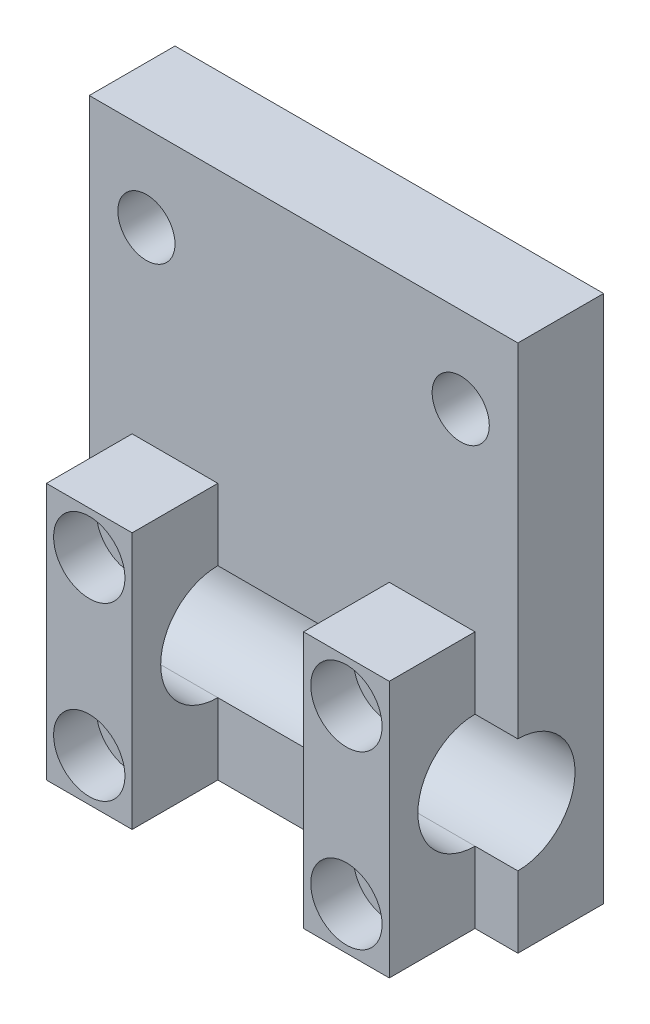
ISO-10303-21;
HEADER;
FILE_DESCRIPTION(('STEP AP214'),'2;1');
FILE_NAME('part.step','',(''),(''),'','','');
FILE_SCHEMA(('AUTOMOTIVE_DESIGN { 1 0 10303 214 1 1 1 1 }'));
ENDSEC;
DATA;
#1=APPLICATION_CONTEXT('core data for automotive mechanical design processes');
#2=APPLICATION_PROTOCOL_DEFINITION('international standard','automotive_design',2000,#1);
#3=PRODUCT_CONTEXT('',#1,'mechanical');
#4=PRODUCT('Part','Part','',(#3));
#5=PRODUCT_RELATED_PRODUCT_CATEGORY('part','',(#4));
#6=PRODUCT_DEFINITION_FORMATION('','',#4);
#7=PRODUCT_DEFINITION_CONTEXT('part definition',#1,'design');
#8=PRODUCT_DEFINITION('design','',#6,#7);
#9=PRODUCT_DEFINITION_SHAPE('','',#8);
#10=(LENGTH_UNIT() NAMED_UNIT(*) SI_UNIT(.MILLI.,.METRE.));
#11=(NAMED_UNIT(*) PLANE_ANGLE_UNIT() SI_UNIT($,.RADIAN.));
#12=(NAMED_UNIT(*) SI_UNIT($,.STERADIAN.) SOLID_ANGLE_UNIT());
#13=UNCERTAINTY_MEASURE_WITH_UNIT(LENGTH_MEASURE(1.E-05),#10,'distance_accuracy_value','');
#14=(GEOMETRIC_REPRESENTATION_CONTEXT(3) GLOBAL_UNCERTAINTY_ASSIGNED_CONTEXT((#13)) GLOBAL_UNIT_ASSIGNED_CONTEXT((#10,
#11,#12)) REPRESENTATION_CONTEXT('',''));
#15=CARTESIAN_POINT('',(0.,0.,0.));
#16=DIRECTION('',(0.,0.,1.));
#17=DIRECTION('',(1.,0.,0.));
#18=AXIS2_PLACEMENT_3D('',#15,#16,#17);
#19=CARTESIAN_POINT('',(0.,0.,0.));
#20=DIRECTION('',(0.,0.,1.));
#21=DIRECTION('',(1.,0.,0.));
#22=AXIS2_PLACEMENT_3D('',#19,#20,#21);
#23=PLANE('',#22);
#24=CARTESIAN_POINT('',(14.2875,-9.525,0.));
#25=DIRECTION('',(0.,0.,1.));
#26=DIRECTION('',(1.,0.,0.));
#27=AXIS2_PLACEMENT_3D('',#24,#25,#26);
#28=CIRCLE('',#27,2.3876);
#29=CARTESIAN_POINT('',(11.8999,-9.525,0.));
#30=VERTEX_POINT('',#29);
#31=EDGE_CURVE('E153',#30,#30,#28,.T.);
#32=ORIENTED_EDGE('',*,*,#31,.T.);
#33=EDGE_LOOP('',(#32));
#34=FACE_BOUND('',#33,.T.);
#35=DIRECTION('',(0.,-1.,0.));
#36=VECTOR('',#35,1.);
#37=CARTESIAN_POINT('',(9.525,14.2748,0.));
#38=LINE('',#37,#36);
#39=CARTESIAN_POINT('',(9.525,-6.35,0.));
#40=VERTEX_POINT('',#39);
#41=CARTESIAN_POINT('',(9.525,-14.2748,0.));
#42=VERTEX_POINT('',#41);
#43=EDGE_CURVE('E91',#40,#42,#38,.T.);
#44=ORIENTED_EDGE('',*,*,#43,.F.);
#45=DIRECTION('',(1.,0.,0.));
#46=VECTOR('',#45,1.);
#47=CARTESIAN_POINT('',(-38.1,-6.35,0.));
#48=LINE('',#47,#46);
#49=CARTESIAN_POINT('',(19.05,-6.35,0.));
#50=VERTEX_POINT('',#49);
#51=EDGE_CURVE('E63',#40,#50,#48,.T.);
#52=ORIENTED_EDGE('',*,*,#51,.T.);
#53=DIRECTION('',(0.,1.,0.));
#54=VECTOR('',#53,1.);
#55=CARTESIAN_POINT('',(19.05,-14.2748,0.));
#56=LINE('',#55,#54);
#57=CARTESIAN_POINT('',(19.05,-14.2748,0.));
#58=VERTEX_POINT('',#57);
#59=EDGE_CURVE('E168',#58,#50,#56,.T.);
#60=ORIENTED_EDGE('',*,*,#59,.F.);
#61=DIRECTION('',(1.,0.,0.));
#62=VECTOR('',#61,1.);
#63=CARTESIAN_POINT('',(9.525,-14.2748,0.));
#64=LINE('',#63,#62);
#65=EDGE_CURVE('E157',#42,#58,#64,.T.);
#66=ORIENTED_EDGE('',*,*,#65,.F.);
#67=EDGE_LOOP('',(#44,#52,#60,#66));
#68=FACE_BOUND('',#67,.T.);
#69=ADVANCED_FACE('F48',(#34,#68),#23,.F.);
#70=CARTESIAN_POINT('',(0.,0.,9.525));
#71=DIRECTION('',(0.,0.,1.));
#72=DIRECTION('',(1.,0.,0.));
#73=AXIS2_PLACEMENT_3D('',#70,#71,#72);
#74=PLANE('',#73);
#75=CARTESIAN_POINT('',(14.2875,9.525,9.525));
#76=DIRECTION('',(0.,0.,1.));
#77=DIRECTION('',(1.,0.,0.));
#78=AXIS2_PLACEMENT_3D('',#75,#76,#77);
#79=CIRCLE('',#78,3.9624);
#80=CARTESIAN_POINT('',(10.3251,9.525,9.525));
#81=VERTEX_POINT('',#80);
#82=EDGE_CURVE('E145',#81,#81,#79,.F.);
#83=ORIENTED_EDGE('',*,*,#82,.T.);
#84=EDGE_LOOP('',(#83));
#85=FACE_BOUND('',#84,.T.);
#86=DIRECTION('',(1.,0.,0.));
#87=VECTOR('',#86,1.);
#88=CARTESIAN_POINT('',(9.525,-14.2748,9.525));
#89=LINE('',#88,#87);
#90=CARTESIAN_POINT('',(9.525,-14.2748,9.525));
#91=VERTEX_POINT('',#90);
#92=CARTESIAN_POINT('',(19.05,-14.2748,9.525));
#93=VERTEX_POINT('',#92);
#94=EDGE_CURVE('E124',#91,#93,#89,.T.);
#95=ORIENTED_EDGE('',*,*,#94,.T.);
#96=DIRECTION('',(0.,1.,0.));
#97=VECTOR('',#96,1.);
#98=CARTESIAN_POINT('',(19.05,-14.2748,9.525));
#99=LINE('',#98,#97);
#100=CARTESIAN_POINT('',(19.05,14.2748,9.525));
#101=VERTEX_POINT('',#100);
#102=EDGE_CURVE('E99',#93,#101,#99,.T.);
#103=ORIENTED_EDGE('',*,*,#102,.T.);
#104=DIRECTION('',(-1.,0.,0.));
#105=VECTOR('',#104,1.);
#106=CARTESIAN_POINT('',(19.05,14.2748,9.525));
#107=LINE('',#106,#105);
#108=CARTESIAN_POINT('',(9.525,14.2748,9.525));
#109=VERTEX_POINT('',#108);
#110=EDGE_CURVE('E164',#101,#109,#107,.T.);
#111=ORIENTED_EDGE('',*,*,#110,.T.);
#112=DIRECTION('',(0.,-1.,0.));
#113=VECTOR('',#112,1.);
#114=CARTESIAN_POINT('',(9.525,14.2748,9.525));
#115=LINE('',#114,#113);
#116=EDGE_CURVE('E71',#109,#91,#115,.T.);
#117=ORIENTED_EDGE('',*,*,#116,.T.);
#118=EDGE_LOOP('',(#95,#103,#111,#117));
#119=FACE_BOUND('',#118,.T.);
#120=CARTESIAN_POINT('',(14.2875,-9.525,9.525));
#121=DIRECTION('',(0.,0.,1.));
#122=DIRECTION('',(1.,0.,0.));
#123=AXIS2_PLACEMENT_3D('',#120,#121,#122);
#124=CIRCLE('',#123,3.9624);
#125=CARTESIAN_POINT('',(10.3251,-9.525,9.525));
#126=VERTEX_POINT('',#125);
#127=EDGE_CURVE('E147',#126,#126,#124,.F.);
#128=ORIENTED_EDGE('',*,*,#127,.T.);
#129=EDGE_LOOP('',(#128));
#130=FACE_BOUND('',#129,.T.);
#131=ADVANCED_FACE('F175',(#85,#119,#130),#74,.T.);
#132=CARTESIAN_POINT('',(14.2875,-9.525,9.525));
#133=DIRECTION('',(0.,0.,-1.));
#134=DIRECTION('',(-1.,0.,0.));
#135=AXIS2_PLACEMENT_3D('',#132,#133,#134);
#136=CYLINDRICAL_SURFACE('',#135,2.3876);
#137=CARTESIAN_POINT('',(14.2875,-9.525,4.7752));
#138=DIRECTION('',(0.,0.,1.));
#139=DIRECTION('',(1.,0.,0.));
#140=AXIS2_PLACEMENT_3D('',#137,#138,#139);
#141=CIRCLE('',#140,2.3876);
#142=CARTESIAN_POINT('',(11.8999,-9.525,4.7752));
#143=VERTEX_POINT('',#142);
#144=EDGE_CURVE('E141',#143,#143,#141,.T.);
#145=CARTESIAN_POINT('',(11.8999,-9.525,0.));
#146=CARTESIAN_POINT('',(11.8999,-9.525,0.0497416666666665));
#147=CARTESIAN_POINT('',(11.8999,-9.525,0.0994833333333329));
#148=CARTESIAN_POINT('',(11.8999,-9.525,0.198966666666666));
#149=CARTESIAN_POINT('',(11.8999,-9.525,0.248708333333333));
#150=CARTESIAN_POINT('',(11.8999,-9.525,0.348191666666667));
#151=CARTESIAN_POINT('',(11.8999,-9.525,0.397933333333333));
#152=CARTESIAN_POINT('',(11.8999,-9.525,0.497416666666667));
#153=CARTESIAN_POINT('',(11.8999,-9.525,0.547158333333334));
#154=CARTESIAN_POINT('',(11.8999,-9.525,0.646641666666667));
#155=CARTESIAN_POINT('',(11.8999,-9.525,0.696383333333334));
#156=CARTESIAN_POINT('',(11.8999,-9.525,0.795866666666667));
#157=CARTESIAN_POINT('',(11.8999,-9.525,0.845608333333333));
#158=CARTESIAN_POINT('',(11.8999,-9.525,0.945091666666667));
#159=CARTESIAN_POINT('',(11.8999,-9.525,0.994833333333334));
#160=CARTESIAN_POINT('',(11.8999,-9.525,1.09431666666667));
#161=CARTESIAN_POINT('',(11.8999,-9.525,1.14405833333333));
#162=CARTESIAN_POINT('',(11.8999,-9.525,1.24354166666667));
#163=CARTESIAN_POINT('',(11.8999,-9.525,1.29328333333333));
#164=CARTESIAN_POINT('',(11.8999,-9.525,1.39276666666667));
#165=CARTESIAN_POINT('',(11.8999,-9.525,1.44250833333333));
#166=CARTESIAN_POINT('',(11.8999,-9.525,1.54199166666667));
#167=CARTESIAN_POINT('',(11.8999,-9.525,1.59173333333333));
#168=CARTESIAN_POINT('',(11.8999,-9.525,1.69121666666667));
#169=CARTESIAN_POINT('',(11.8999,-9.525,1.74095833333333));
#170=CARTESIAN_POINT('',(11.8999,-9.525,1.84044166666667));
#171=CARTESIAN_POINT('',(11.8999,-9.525,1.89018333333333));
#172=CARTESIAN_POINT('',(11.8999,-9.525,1.98966666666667));
#173=CARTESIAN_POINT('',(11.8999,-9.525,2.03940833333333));
#174=CARTESIAN_POINT('',(11.8999,-9.525,2.13889166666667));
#175=CARTESIAN_POINT('',(11.8999,-9.525,2.18863333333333));
#176=CARTESIAN_POINT('',(11.8999,-9.525,2.28811666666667));
#177=CARTESIAN_POINT('',(11.8999,-9.525,2.33785833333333));
#178=CARTESIAN_POINT('',(11.8999,-9.525,2.43734166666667));
#179=CARTESIAN_POINT('',(11.8999,-9.525,2.48708333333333));
#180=CARTESIAN_POINT('',(11.8999,-9.525,2.58656666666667));
#181=CARTESIAN_POINT('',(11.8999,-9.525,2.63630833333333));
#182=CARTESIAN_POINT('',(11.8999,-9.525,2.73579166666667));
#183=CARTESIAN_POINT('',(11.8999,-9.525,2.78553333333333));
#184=CARTESIAN_POINT('',(11.8999,-9.525,2.88501666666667));
#185=CARTESIAN_POINT('',(11.8999,-9.525,2.93475833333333));
#186=CARTESIAN_POINT('',(11.8999,-9.525,3.03424166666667));
#187=CARTESIAN_POINT('',(11.8999,-9.525,3.08398333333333));
#188=CARTESIAN_POINT('',(11.8999,-9.525,3.18346666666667));
#189=CARTESIAN_POINT('',(11.8999,-9.525,3.23320833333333));
#190=CARTESIAN_POINT('',(11.8999,-9.525,3.33269166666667));
#191=CARTESIAN_POINT('',(11.8999,-9.525,3.38243333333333));
#192=CARTESIAN_POINT('',(11.8999,-9.525,3.48191666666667));
#193=CARTESIAN_POINT('',(11.8999,-9.525,3.53165833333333));
#194=CARTESIAN_POINT('',(11.8999,-9.525,3.63114166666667));
#195=CARTESIAN_POINT('',(11.8999,-9.525,3.68088333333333));
#196=CARTESIAN_POINT('',(11.8999,-9.525,3.78036666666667));
#197=CARTESIAN_POINT('',(11.8999,-9.525,3.83010833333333));
#198=CARTESIAN_POINT('',(11.8999,-9.525,3.92959166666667));
#199=CARTESIAN_POINT('',(11.8999,-9.525,3.97933333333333));
#200=CARTESIAN_POINT('',(11.8999,-9.525,4.07881666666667));
#201=CARTESIAN_POINT('',(11.8999,-9.525,4.12855833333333));
#202=CARTESIAN_POINT('',(11.8999,-9.525,4.22804166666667));
#203=CARTESIAN_POINT('',(11.8999,-9.525,4.27778333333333));
#204=CARTESIAN_POINT('',(11.8999,-9.525,4.37726666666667));
#205=CARTESIAN_POINT('',(11.8999,-9.525,4.42700833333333));
#206=CARTESIAN_POINT('',(11.8999,-9.525,4.52649166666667));
#207=CARTESIAN_POINT('',(11.8999,-9.525,4.57623333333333));
#208=CARTESIAN_POINT('',(11.8999,-9.525,4.67571666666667));
#209=CARTESIAN_POINT('',(11.8999,-9.525,4.72545833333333));
#210=CARTESIAN_POINT('',(11.8999,-9.525,4.7752));
#211=B_SPLINE_CURVE_WITH_KNOTS('',3,(#145,#146,#147,#148,#149,#150,#151,#152,#153,#154,#155,
#156,#157,#158,#159,#160,#161,#162,#163,#164,#165,#166,#167,#168,#169,#170,#171,#172,#173,#174,
#175,#176,#177,#178,#179,#180,#181,#182,#183,#184,#185,#186,#187,#188,#189,#190,#191,#192,#193,
#194,#195,#196,#197,#198,#199,#200,#201,#202,#203,#204,#205,#206,#207,#208,#209,#210),
.UNSPECIFIED.,.F.,.F.,(4,2,2,2,2,2,2,2,2,2,2,2,2,2,2,2,2,2,2,2,2,2,2,2,2,2,2,2,2,2,2,2,4),(0.,
0.149224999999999,0.29845,0.447675,0.596900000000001,0.746125,0.89535,1.044575,1.1938,1.343025,
1.49225,1.641475,1.7907,1.939925,2.08915,2.238375,2.3876,2.536825,2.68605,2.835275,2.9845,
3.133725,3.28295,3.432175,3.5814,3.730625,3.87985,4.029075,4.1783,4.327525,4.47675,4.625975,
4.7752),.UNSPECIFIED.);
#212=EDGE_CURVE('BSEAM211',#30,#143,#211,.T.);
#213=ORIENTED_EDGE('',*,*,#31,.F.);
#214=ORIENTED_EDGE('',*,*,#144,.T.);
#215=ORIENTED_EDGE('',*,*,#212,.T.);
#216=ORIENTED_EDGE('',*,*,#212,.F.);
#217=EDGE_LOOP('',(#213,#215,#214,#216));
#218=FACE_BOUND('',#217,.T.);
#219=ADVANCED_FACE('F211',(#218),#136,.F.);
#220=CARTESIAN_POINT('',(14.2875,9.525,9.525));
#221=DIRECTION('',(0.,0.,-1.));
#222=DIRECTION('',(-1.,0.,0.));
#223=AXIS2_PLACEMENT_3D('',#220,#221,#222);
#224=CYLINDRICAL_SURFACE('',#223,2.3876);
#225=CARTESIAN_POINT('',(14.2875,9.525,0.));
#226=DIRECTION('',(0.,0.,1.));
#227=DIRECTION('',(1.,0.,0.));
#228=AXIS2_PLACEMENT_3D('',#225,#226,#227);
#229=CIRCLE('',#228,2.3876);
#230=CARTESIAN_POINT('',(11.8999,9.525,0.));
#231=VERTEX_POINT('',#230);
#232=EDGE_CURVE('E149',#231,#231,#229,.T.);
#233=CARTESIAN_POINT('',(14.2875,9.525,4.7752));
#234=DIRECTION('',(0.,0.,1.));
#235=DIRECTION('',(1.,0.,0.));
#236=AXIS2_PLACEMENT_3D('',#233,#234,#235);
#237=CIRCLE('',#236,2.3876);
#238=CARTESIAN_POINT('',(11.8999,9.525,4.7752));
#239=VERTEX_POINT('',#238);
#240=EDGE_CURVE('E138',#239,#239,#237,.T.);
#241=CARTESIAN_POINT('',(11.8999,9.525,0.));
#242=CARTESIAN_POINT('',(11.8999,9.525,0.0497416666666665));
#243=CARTESIAN_POINT('',(11.8999,9.525,0.0994833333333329));
#244=CARTESIAN_POINT('',(11.8999,9.525,0.198966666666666));
#245=CARTESIAN_POINT('',(11.8999,9.525,0.248708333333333));
#246=CARTESIAN_POINT('',(11.8999,9.525,0.348191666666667));
#247=CARTESIAN_POINT('',(11.8999,9.525,0.397933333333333));
#248=CARTESIAN_POINT('',(11.8999,9.525,0.497416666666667));
#249=CARTESIAN_POINT('',(11.8999,9.525,0.547158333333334));
#250=CARTESIAN_POINT('',(11.8999,9.525,0.646641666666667));
#251=CARTESIAN_POINT('',(11.8999,9.525,0.696383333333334));
#252=CARTESIAN_POINT('',(11.8999,9.525,0.795866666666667));
#253=CARTESIAN_POINT('',(11.8999,9.525,0.845608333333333));
#254=CARTESIAN_POINT('',(11.8999,9.525,0.945091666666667));
#255=CARTESIAN_POINT('',(11.8999,9.525,0.994833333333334));
#256=CARTESIAN_POINT('',(11.8999,9.525,1.09431666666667));
#257=CARTESIAN_POINT('',(11.8999,9.525,1.14405833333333));
#258=CARTESIAN_POINT('',(11.8999,9.525,1.24354166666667));
#259=CARTESIAN_POINT('',(11.8999,9.525,1.29328333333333));
#260=CARTESIAN_POINT('',(11.8999,9.525,1.39276666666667));
#261=CARTESIAN_POINT('',(11.8999,9.525,1.44250833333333));
#262=CARTESIAN_POINT('',(11.8999,9.525,1.54199166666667));
#263=CARTESIAN_POINT('',(11.8999,9.525,1.59173333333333));
#264=CARTESIAN_POINT('',(11.8999,9.525,1.69121666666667));
#265=CARTESIAN_POINT('',(11.8999,9.525,1.74095833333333));
#266=CARTESIAN_POINT('',(11.8999,9.525,1.84044166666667));
#267=CARTESIAN_POINT('',(11.8999,9.525,1.89018333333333));
#268=CARTESIAN_POINT('',(11.8999,9.525,1.98966666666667));
#269=CARTESIAN_POINT('',(11.8999,9.525,2.03940833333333));
#270=CARTESIAN_POINT('',(11.8999,9.525,2.13889166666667));
#271=CARTESIAN_POINT('',(11.8999,9.525,2.18863333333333));
#272=CARTESIAN_POINT('',(11.8999,9.525,2.28811666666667));
#273=CARTESIAN_POINT('',(11.8999,9.525,2.33785833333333));
#274=CARTESIAN_POINT('',(11.8999,9.525,2.43734166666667));
#275=CARTESIAN_POINT('',(11.8999,9.525,2.48708333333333));
#276=CARTESIAN_POINT('',(11.8999,9.525,2.58656666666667));
#277=CARTESIAN_POINT('',(11.8999,9.525,2.63630833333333));
#278=CARTESIAN_POINT('',(11.8999,9.525,2.73579166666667));
#279=CARTESIAN_POINT('',(11.8999,9.525,2.78553333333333));
#280=CARTESIAN_POINT('',(11.8999,9.525,2.88501666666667));
#281=CARTESIAN_POINT('',(11.8999,9.525,2.93475833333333));
#282=CARTESIAN_POINT('',(11.8999,9.525,3.03424166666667));
#283=CARTESIAN_POINT('',(11.8999,9.525,3.08398333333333));
#284=CARTESIAN_POINT('',(11.8999,9.525,3.18346666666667));
#285=CARTESIAN_POINT('',(11.8999,9.525,3.23320833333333));
#286=CARTESIAN_POINT('',(11.8999,9.525,3.33269166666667));
#287=CARTESIAN_POINT('',(11.8999,9.525,3.38243333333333));
#288=CARTESIAN_POINT('',(11.8999,9.525,3.48191666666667));
#289=CARTESIAN_POINT('',(11.8999,9.525,3.53165833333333));
#290=CARTESIAN_POINT('',(11.8999,9.525,3.63114166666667));
#291=CARTESIAN_POINT('',(11.8999,9.525,3.68088333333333));
#292=CARTESIAN_POINT('',(11.8999,9.525,3.78036666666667));
#293=CARTESIAN_POINT('',(11.8999,9.525,3.83010833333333));
#294=CARTESIAN_POINT('',(11.8999,9.525,3.92959166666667));
#295=CARTESIAN_POINT('',(11.8999,9.525,3.97933333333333));
#296=CARTESIAN_POINT('',(11.8999,9.525,4.07881666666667));
#297=CARTESIAN_POINT('',(11.8999,9.525,4.12855833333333));
#298=CARTESIAN_POINT('',(11.8999,9.525,4.22804166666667));
#299=CARTESIAN_POINT('',(11.8999,9.525,4.27778333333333));
#300=CARTESIAN_POINT('',(11.8999,9.525,4.37726666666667));
#301=CARTESIAN_POINT('',(11.8999,9.525,4.42700833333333));
#302=CARTESIAN_POINT('',(11.8999,9.525,4.52649166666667));
#303=CARTESIAN_POINT('',(11.8999,9.525,4.57623333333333));
#304=CARTESIAN_POINT('',(11.8999,9.525,4.67571666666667));
#305=CARTESIAN_POINT('',(11.8999,9.525,4.72545833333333));
#306=CARTESIAN_POINT('',(11.8999,9.525,4.7752));
#307=B_SPLINE_CURVE_WITH_KNOTS('',3,(#241,#242,#243,#244,#245,#246,#247,#248,#249,#250,#251,
#252,#253,#254,#255,#256,#257,#258,#259,#260,#261,#262,#263,#264,#265,#266,#267,#268,#269,#270,
#271,#272,#273,#274,#275,#276,#277,#278,#279,#280,#281,#282,#283,#284,#285,#286,#287,#288,#289,
#290,#291,#292,#293,#294,#295,#296,#297,#298,#299,#300,#301,#302,#303,#304,#305,#306),
.UNSPECIFIED.,.F.,.F.,(4,2,2,2,2,2,2,2,2,2,2,2,2,2,2,2,2,2,2,2,2,2,2,2,2,2,2,2,2,2,2,2,4),(0.,
0.149224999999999,0.29845,0.447675,0.596900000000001,0.746125,0.89535,1.044575,1.1938,1.343025,
1.49225,1.641475,1.7907,1.939925,2.08915,2.238375,2.3876,2.536825,2.68605,2.835275,2.9845,
3.133725,3.28295,3.432175,3.5814,3.730625,3.87985,4.029075,4.1783,4.327525,4.47675,4.625975,
4.7752),.UNSPECIFIED.);
#308=EDGE_CURVE('BSEAM215',#231,#239,#307,.T.);
#309=ORIENTED_EDGE('',*,*,#232,.F.);
#310=ORIENTED_EDGE('',*,*,#240,.T.);
#311=ORIENTED_EDGE('',*,*,#308,.T.);
#312=ORIENTED_EDGE('',*,*,#308,.F.);
#313=EDGE_LOOP('',(#309,#311,#310,#312));
#314=FACE_BOUND('',#313,.T.);
#315=ADVANCED_FACE('F215',(#314),#224,.F.);
#316=CARTESIAN_POINT('',(19.05,6.35,0.));
#317=VERTEX_POINT('',#316);
#318=CARTESIAN_POINT('',(19.05,14.2748,0.));
#319=VERTEX_POINT('',#318);
#320=EDGE_CURVE('E118',#317,#319,#56,.T.);
#321=ORIENTED_EDGE('',*,*,#320,.F.);
#322=DIRECTION('',(1.,0.,0.));
#323=VECTOR('',#322,1.);
#324=CARTESIAN_POINT('',(-38.1,6.35,0.));
#325=LINE('',#324,#323);
#326=CARTESIAN_POINT('',(9.525,6.35,0.));
#327=VERTEX_POINT('',#326);
#328=EDGE_CURVE('E108',#317,#327,#325,.F.);
#329=ORIENTED_EDGE('',*,*,#328,.T.);
#330=CARTESIAN_POINT('',(9.525,14.2748,0.));
#331=VERTEX_POINT('',#330);
#332=EDGE_CURVE('E117',#331,#327,#38,.T.);
#333=ORIENTED_EDGE('',*,*,#332,.F.);
#334=DIRECTION('',(-1.,0.,0.));
#335=VECTOR('',#334,1.);
#336=CARTESIAN_POINT('',(19.05,14.2748,0.));
#337=LINE('',#336,#335);
#338=EDGE_CURVE('E127',#319,#331,#337,.T.);
#339=ORIENTED_EDGE('',*,*,#338,.F.);
#340=EDGE_LOOP('',(#321,#329,#333,#339));
#341=FACE_BOUND('',#340,.T.);
#342=ORIENTED_EDGE('',*,*,#232,.T.);
#343=EDGE_LOOP('',(#342));
#344=FACE_BOUND('',#343,.T.);
#345=ADVANCED_FACE('F114',(#341,#344),#23,.F.);
#346=CARTESIAN_POINT('',(9.525,-14.2748,9.525));
#347=DIRECTION('',(0.,1.,0.));
#348=DIRECTION('',(0.,0.,1.));
#349=AXIS2_PLACEMENT_3D('',#346,#347,#348);
#350=PLANE('',#349);
#351=ORIENTED_EDGE('',*,*,#65,.T.);
#352=DIRECTION('',(0.,0.,-1.));
#353=VECTOR('',#352,1.);
#354=CARTESIAN_POINT('',(19.05,-14.2748,9.525));
#355=LINE('',#354,#353);
#356=EDGE_CURVE('E56',#93,#58,#355,.T.);
#357=ORIENTED_EDGE('',*,*,#356,.F.);
#358=ORIENTED_EDGE('',*,*,#94,.F.);
#359=DIRECTION('',(0.,0.,-1.));
#360=VECTOR('',#359,1.);
#361=CARTESIAN_POINT('',(9.525,-14.2748,9.525));
#362=LINE('',#361,#360);
#363=EDGE_CURVE('E131',#91,#42,#362,.T.);
#364=ORIENTED_EDGE('',*,*,#363,.T.);
#365=EDGE_LOOP('',(#351,#357,#358,#364));
#366=FACE_BOUND('',#365,.T.);
#367=ADVANCED_FACE('F50',(#366),#350,.F.);
#368=CARTESIAN_POINT('',(19.05,-14.2748,9.525));
#369=DIRECTION('',(-1.,0.,0.));
#370=DIRECTION('',(0.,0.,1.));
#371=AXIS2_PLACEMENT_3D('',#368,#369,#370);
#372=PLANE('',#371);
#373=ORIENTED_EDGE('',*,*,#59,.T.);
#374=CARTESIAN_POINT('',(19.05,0.,0.));
#375=DIRECTION('',(-1.,0.,0.));
#376=DIRECTION('',(0.,0.,1.));
#377=AXIS2_PLACEMENT_3D('',#374,#375,#376);
#378=CIRCLE('',#377,6.35);
#379=EDGE_CURVE('E172',#50,#317,#378,.T.);
#380=ORIENTED_EDGE('',*,*,#379,.T.);
#381=ORIENTED_EDGE('',*,*,#320,.T.);
#382=DIRECTION('',(0.,0.,-1.));
#383=VECTOR('',#382,1.);
#384=CARTESIAN_POINT('',(19.05,14.2748,9.525));
#385=LINE('',#384,#383);
#386=EDGE_CURVE('E134',#101,#319,#385,.T.);
#387=ORIENTED_EDGE('',*,*,#386,.F.);
#388=ORIENTED_EDGE('',*,*,#102,.F.);
#389=ORIENTED_EDGE('',*,*,#356,.T.);
#390=EDGE_LOOP('',(#373,#380,#381,#387,#388,#389));
#391=FACE_BOUND('',#390,.T.);
#392=ADVANCED_FACE('F170',(#391),#372,.F.);
#393=CARTESIAN_POINT('',(19.05,14.2748,9.525));
#394=DIRECTION('',(0.,-1.,0.));
#395=DIRECTION('',(0.,0.,-1.));
#396=AXIS2_PLACEMENT_3D('',#393,#394,#395);
#397=PLANE('',#396);
#398=ORIENTED_EDGE('',*,*,#338,.T.);
#399=DIRECTION('',(0.,0.,-1.));
#400=VECTOR('',#399,1.);
#401=CARTESIAN_POINT('',(9.525,14.2748,9.525));
#402=LINE('',#401,#400);
#403=EDGE_CURVE('E123',#109,#331,#402,.T.);
#404=ORIENTED_EDGE('',*,*,#403,.F.);
#405=ORIENTED_EDGE('',*,*,#110,.F.);
#406=ORIENTED_EDGE('',*,*,#386,.T.);
#407=EDGE_LOOP('',(#398,#404,#405,#406));
#408=FACE_BOUND('',#407,.T.);
#409=ADVANCED_FACE('F174',(#408),#397,.F.);
#410=CARTESIAN_POINT('',(9.525,14.2748,9.525));
#411=DIRECTION('',(1.,0.,0.));
#412=DIRECTION('',(0.,0.,-1.));
#413=AXIS2_PLACEMENT_3D('',#410,#411,#412);
#414=PLANE('',#413);
#415=ORIENTED_EDGE('',*,*,#332,.T.);
#416=CARTESIAN_POINT('',(9.525,0.,0.));
#417=DIRECTION('',(1.,0.,0.));
#418=DIRECTION('',(0.,0.,-1.));
#419=AXIS2_PLACEMENT_3D('',#416,#417,#418);
#420=CIRCLE('',#419,6.35);
#421=EDGE_CURVE('E12',#327,#40,#420,.T.);
#422=ORIENTED_EDGE('',*,*,#421,.T.);
#423=ORIENTED_EDGE('',*,*,#43,.T.);
#424=ORIENTED_EDGE('',*,*,#363,.F.);
#425=ORIENTED_EDGE('',*,*,#116,.F.);
#426=ORIENTED_EDGE('',*,*,#403,.T.);
#427=EDGE_LOOP('',(#415,#422,#423,#424,#425,#426));
#428=FACE_BOUND('',#427,.T.);
#429=ADVANCED_FACE('F121',(#428),#414,.F.);
#430=CARTESIAN_POINT('',(14.2875,9.525,14.3002));
#431=DIRECTION('',(0.,0.,-1.));
#432=DIRECTION('',(-1.,0.,0.));
#433=AXIS2_PLACEMENT_3D('',#430,#431,#432);
#434=CYLINDRICAL_SURFACE('',#433,3.9624);
#435=CARTESIAN_POINT('',(14.2875,9.525,4.7752));
#436=DIRECTION('',(0.,0.,1.));
#437=DIRECTION('',(1.,0.,0.));
#438=AXIS2_PLACEMENT_3D('',#435,#436,#437);
#439=CIRCLE('',#438,3.9624);
#440=CARTESIAN_POINT('',(10.3251,9.525,4.7752));
#441=VERTEX_POINT('',#440);
#442=EDGE_CURVE('E160',#441,#441,#439,.T.);
#443=CARTESIAN_POINT('',(10.3251,9.525,9.525));
#444=CARTESIAN_POINT('',(10.3251,9.525,9.47552291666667));
#445=CARTESIAN_POINT('',(10.3251,9.525,9.42604583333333));
#446=CARTESIAN_POINT('',(10.3251,9.525,9.32709166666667));
#447=CARTESIAN_POINT('',(10.3251,9.525,9.27761458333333));
#448=CARTESIAN_POINT('',(10.3251,9.525,9.17866041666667));
#449=CARTESIAN_POINT('',(10.3251,9.525,9.12918333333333));
#450=CARTESIAN_POINT('',(10.3251,9.525,9.03022916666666));
#451=CARTESIAN_POINT('',(10.3251,9.525,8.98075208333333));
#452=CARTESIAN_POINT('',(10.3251,9.525,8.88179791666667));
#453=CARTESIAN_POINT('',(10.3251,9.525,8.83232083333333));
#454=CARTESIAN_POINT('',(10.3251,9.525,8.73336666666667));
#455=CARTESIAN_POINT('',(10.3251,9.525,8.68388958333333));
#456=CARTESIAN_POINT('',(10.3251,9.525,8.58493541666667));
#457=CARTESIAN_POINT('',(10.3251,9.525,8.53545833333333));
#458=CARTESIAN_POINT('',(10.3251,9.525,8.43650416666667));
#459=CARTESIAN_POINT('',(10.3251,9.525,8.38702708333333));
#460=CARTESIAN_POINT('',(10.3251,9.525,8.28807291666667));
#461=CARTESIAN_POINT('',(10.3251,9.525,8.23859583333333));
#462=CARTESIAN_POINT('',(10.3251,9.525,8.13964166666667));
#463=CARTESIAN_POINT('',(10.3251,9.525,8.09016458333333));
#464=CARTESIAN_POINT('',(10.3251,9.525,7.99121041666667));
#465=CARTESIAN_POINT('',(10.3251,9.525,7.94173333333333));
#466=CARTESIAN_POINT('',(10.3251,9.525,7.84277916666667));
#467=CARTESIAN_POINT('',(10.3251,9.525,7.79330208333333));
#468=CARTESIAN_POINT('',(10.3251,9.525,7.69434791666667));
#469=CARTESIAN_POINT('',(10.3251,9.525,7.64487083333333));
#470=CARTESIAN_POINT('',(10.3251,9.525,7.54591666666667));
#471=CARTESIAN_POINT('',(10.3251,9.525,7.49643958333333));
#472=CARTESIAN_POINT('',(10.3251,9.525,7.39748541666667));
#473=CARTESIAN_POINT('',(10.3251,9.525,7.34800833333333));
#474=CARTESIAN_POINT('',(10.3251,9.525,7.24905416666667));
#475=CARTESIAN_POINT('',(10.3251,9.525,7.19957708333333));
#476=CARTESIAN_POINT('',(10.3251,9.525,7.10062291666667));
#477=CARTESIAN_POINT('',(10.3251,9.525,7.05114583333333));
#478=CARTESIAN_POINT('',(10.3251,9.525,6.95219166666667));
#479=CARTESIAN_POINT('',(10.3251,9.525,6.90271458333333));
#480=CARTESIAN_POINT('',(10.3251,9.525,6.80376041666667));
#481=CARTESIAN_POINT('',(10.3251,9.525,6.75428333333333));
#482=CARTESIAN_POINT('',(10.3251,9.525,6.65532916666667));
#483=CARTESIAN_POINT('',(10.3251,9.525,6.60585208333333));
#484=CARTESIAN_POINT('',(10.3251,9.525,6.50689791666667));
#485=CARTESIAN_POINT('',(10.3251,9.525,6.45742083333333));
#486=CARTESIAN_POINT('',(10.3251,9.525,6.35846666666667));
#487=CARTESIAN_POINT('',(10.3251,9.525,6.30898958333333));
#488=CARTESIAN_POINT('',(10.3251,9.525,6.21003541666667));
#489=CARTESIAN_POINT('',(10.3251,9.525,6.16055833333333));
#490=CARTESIAN_POINT('',(10.3251,9.525,6.06160416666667));
#491=CARTESIAN_POINT('',(10.3251,9.525,6.01212708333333));
#492=CARTESIAN_POINT('',(10.3251,9.525,5.91317291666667));
#493=CARTESIAN_POINT('',(10.3251,9.525,5.86369583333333));
#494=CARTESIAN_POINT('',(10.3251,9.525,5.76474166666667));
#495=CARTESIAN_POINT('',(10.3251,9.525,5.71526458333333));
#496=CARTESIAN_POINT('',(10.3251,9.525,5.61631041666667));
#497=CARTESIAN_POINT('',(10.3251,9.525,5.56683333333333));
#498=CARTESIAN_POINT('',(10.3251,9.525,5.46787916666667));
#499=CARTESIAN_POINT('',(10.3251,9.525,5.41840208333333));
#500=CARTESIAN_POINT('',(10.3251,9.525,5.31944791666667));
#501=CARTESIAN_POINT('',(10.3251,9.525,5.26997083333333));
#502=CARTESIAN_POINT('',(10.3251,9.525,5.17101666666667));
#503=CARTESIAN_POINT('',(10.3251,9.525,5.12153958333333));
#504=CARTESIAN_POINT('',(10.3251,9.525,5.02258541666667));
#505=CARTESIAN_POINT('',(10.3251,9.525,4.97310833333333));
#506=CARTESIAN_POINT('',(10.3251,9.525,4.87415416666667));
#507=CARTESIAN_POINT('',(10.3251,9.525,4.82467708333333));
#508=CARTESIAN_POINT('',(10.3251,9.525,4.7752));
#509=B_SPLINE_CURVE_WITH_KNOTS('',3,(#443,#444,#445,#446,#447,#448,#449,#450,#451,#452,#453,
#454,#455,#456,#457,#458,#459,#460,#461,#462,#463,#464,#465,#466,#467,#468,#469,#470,#471,#472,
#473,#474,#475,#476,#477,#478,#479,#480,#481,#482,#483,#484,#485,#486,#487,#488,#489,#490,#491,
#492,#493,#494,#495,#496,#497,#498,#499,#500,#501,#502,#503,#504,#505,#506,#507,#508),
.UNSPECIFIED.,.F.,.F.,(4,2,2,2,2,2,2,2,2,2,2,2,2,2,2,2,2,2,2,2,2,2,2,2,2,2,2,2,2,2,2,2,4),(0.,
0.148431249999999,0.296862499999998,0.445293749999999,0.593725,0.742156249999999,
0.890587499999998,1.03901875,1.18745,1.33588125,1.4843125,1.63274375,1.781175,1.92960625,
2.0780375,2.22646875,2.3749,2.52333125,2.6717625,2.82019375,2.968625,3.11705625,3.2654875,
3.41391875,3.56235,3.71078125,3.8592125,4.00764375,4.156075,4.30450625,4.4529375,4.60136875,
4.7498),.UNSPECIFIED.);
#510=EDGE_CURVE('BSEAM191',#81,#441,#509,.T.);
#511=ORIENTED_EDGE('',*,*,#82,.F.);
#512=ORIENTED_EDGE('',*,*,#442,.F.);
#513=ORIENTED_EDGE('',*,*,#510,.T.);
#514=ORIENTED_EDGE('',*,*,#510,.F.);
#515=EDGE_LOOP('',(#511,#513,#512,#514));
#516=FACE_BOUND('',#515,.T.);
#517=ADVANCED_FACE('F191',(#516),#434,.F.);
#518=CARTESIAN_POINT('',(14.2875,9.525,4.7752));
#519=DIRECTION('',(0.,0.,1.));
#520=DIRECTION('',(1.,0.,0.));
#521=AXIS2_PLACEMENT_3D('',#518,#519,#520);
#522=PLANE('',#521);
#523=ORIENTED_EDGE('',*,*,#240,.F.);
#524=EDGE_LOOP('',(#523));
#525=FACE_BOUND('',#524,.T.);
#526=ORIENTED_EDGE('',*,*,#442,.T.);
#527=EDGE_LOOP('',(#526));
#528=FACE_BOUND('',#527,.T.);
#529=ADVANCED_FACE('F189',(#525,#528),#522,.T.);
#530=CARTESIAN_POINT('',(14.2875,-9.525,14.3002));
#531=DIRECTION('',(0.,0.,-1.));
#532=DIRECTION('',(-1.,0.,0.));
#533=AXIS2_PLACEMENT_3D('',#530,#531,#532);
#534=CYLINDRICAL_SURFACE('',#533,3.9624);
#535=CARTESIAN_POINT('',(14.2875,-9.525,4.7752));
#536=DIRECTION('',(0.,0.,1.));
#537=DIRECTION('',(1.,0.,0.));
#538=AXIS2_PLACEMENT_3D('',#535,#536,#537);
#539=CIRCLE('',#538,3.9624);
#540=CARTESIAN_POINT('',(10.3251,-9.525,4.7752));
#541=VERTEX_POINT('',#540);
#542=EDGE_CURVE('E142',#541,#541,#539,.T.);
#543=CARTESIAN_POINT('',(10.3251,-9.525,9.525));
#544=CARTESIAN_POINT('',(10.3251,-9.525,9.47552291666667));
#545=CARTESIAN_POINT('',(10.3251,-9.525,9.42604583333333));
#546=CARTESIAN_POINT('',(10.3251,-9.525,9.32709166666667));
#547=CARTESIAN_POINT('',(10.3251,-9.525,9.27761458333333));
#548=CARTESIAN_POINT('',(10.3251,-9.525,9.17866041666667));
#549=CARTESIAN_POINT('',(10.3251,-9.525,9.12918333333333));
#550=CARTESIAN_POINT('',(10.3251,-9.525,9.03022916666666));
#551=CARTESIAN_POINT('',(10.3251,-9.525,8.98075208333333));
#552=CARTESIAN_POINT('',(10.3251,-9.525,8.88179791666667));
#553=CARTESIAN_POINT('',(10.3251,-9.525,8.83232083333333));
#554=CARTESIAN_POINT('',(10.3251,-9.525,8.73336666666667));
#555=CARTESIAN_POINT('',(10.3251,-9.525,8.68388958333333));
#556=CARTESIAN_POINT('',(10.3251,-9.525,8.58493541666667));
#557=CARTESIAN_POINT('',(10.3251,-9.525,8.53545833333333));
#558=CARTESIAN_POINT('',(10.3251,-9.525,8.43650416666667));
#559=CARTESIAN_POINT('',(10.3251,-9.525,8.38702708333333));
#560=CARTESIAN_POINT('',(10.3251,-9.525,8.28807291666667));
#561=CARTESIAN_POINT('',(10.3251,-9.525,8.23859583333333));
#562=CARTESIAN_POINT('',(10.3251,-9.525,8.13964166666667));
#563=CARTESIAN_POINT('',(10.3251,-9.525,8.09016458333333));
#564=CARTESIAN_POINT('',(10.3251,-9.525,7.99121041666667));
#565=CARTESIAN_POINT('',(10.3251,-9.525,7.94173333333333));
#566=CARTESIAN_POINT('',(10.3251,-9.525,7.84277916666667));
#567=CARTESIAN_POINT('',(10.3251,-9.525,7.79330208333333));
#568=CARTESIAN_POINT('',(10.3251,-9.525,7.69434791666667));
#569=CARTESIAN_POINT('',(10.3251,-9.525,7.64487083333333));
#570=CARTESIAN_POINT('',(10.3251,-9.525,7.54591666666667));
#571=CARTESIAN_POINT('',(10.3251,-9.525,7.49643958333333));
#572=CARTESIAN_POINT('',(10.3251,-9.525,7.39748541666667));
#573=CARTESIAN_POINT('',(10.3251,-9.525,7.34800833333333));
#574=CARTESIAN_POINT('',(10.3251,-9.525,7.24905416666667));
#575=CARTESIAN_POINT('',(10.3251,-9.525,7.19957708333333));
#576=CARTESIAN_POINT('',(10.3251,-9.525,7.10062291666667));
#577=CARTESIAN_POINT('',(10.3251,-9.525,7.05114583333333));
#578=CARTESIAN_POINT('',(10.3251,-9.525,6.95219166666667));
#579=CARTESIAN_POINT('',(10.3251,-9.525,6.90271458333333));
#580=CARTESIAN_POINT('',(10.3251,-9.525,6.80376041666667));
#581=CARTESIAN_POINT('',(10.3251,-9.525,6.75428333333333));
#582=CARTESIAN_POINT('',(10.3251,-9.525,6.65532916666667));
#583=CARTESIAN_POINT('',(10.3251,-9.525,6.60585208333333));
#584=CARTESIAN_POINT('',(10.3251,-9.525,6.50689791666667));
#585=CARTESIAN_POINT('',(10.3251,-9.525,6.45742083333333));
#586=CARTESIAN_POINT('',(10.3251,-9.525,6.35846666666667));
#587=CARTESIAN_POINT('',(10.3251,-9.525,6.30898958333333));
#588=CARTESIAN_POINT('',(10.3251,-9.525,6.21003541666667));
#589=CARTESIAN_POINT('',(10.3251,-9.525,6.16055833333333));
#590=CARTESIAN_POINT('',(10.3251,-9.525,6.06160416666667));
#591=CARTESIAN_POINT('',(10.3251,-9.525,6.01212708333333));
#592=CARTESIAN_POINT('',(10.3251,-9.525,5.91317291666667));
#593=CARTESIAN_POINT('',(10.3251,-9.525,5.86369583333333));
#594=CARTESIAN_POINT('',(10.3251,-9.525,5.76474166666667));
#595=CARTESIAN_POINT('',(10.3251,-9.525,5.71526458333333));
#596=CARTESIAN_POINT('',(10.3251,-9.525,5.61631041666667));
#597=CARTESIAN_POINT('',(10.3251,-9.525,5.56683333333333));
#598=CARTESIAN_POINT('',(10.3251,-9.525,5.46787916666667));
#599=CARTESIAN_POINT('',(10.3251,-9.525,5.41840208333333));
#600=CARTESIAN_POINT('',(10.3251,-9.525,5.31944791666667));
#601=CARTESIAN_POINT('',(10.3251,-9.525,5.26997083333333));
#602=CARTESIAN_POINT('',(10.3251,-9.525,5.17101666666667));
#603=CARTESIAN_POINT('',(10.3251,-9.525,5.12153958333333));
#604=CARTESIAN_POINT('',(10.3251,-9.525,5.02258541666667));
#605=CARTESIAN_POINT('',(10.3251,-9.525,4.97310833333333));
#606=CARTESIAN_POINT('',(10.3251,-9.525,4.87415416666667));
#607=CARTESIAN_POINT('',(10.3251,-9.525,4.82467708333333));
#608=CARTESIAN_POINT('',(10.3251,-9.525,4.7752));
#609=B_SPLINE_CURVE_WITH_KNOTS('',3,(#543,#544,#545,#546,#547,#548,#549,#550,#551,#552,#553,
#554,#555,#556,#557,#558,#559,#560,#561,#562,#563,#564,#565,#566,#567,#568,#569,#570,#571,#572,
#573,#574,#575,#576,#577,#578,#579,#580,#581,#582,#583,#584,#585,#586,#587,#588,#589,#590,#591,
#592,#593,#594,#595,#596,#597,#598,#599,#600,#601,#602,#603,#604,#605,#606,#607,#608),
.UNSPECIFIED.,.F.,.F.,(4,2,2,2,2,2,2,2,2,2,2,2,2,2,2,2,2,2,2,2,2,2,2,2,2,2,2,2,2,2,2,2,4),(0.,
0.148431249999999,0.296862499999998,0.445293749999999,0.593725,0.742156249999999,
0.890587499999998,1.03901875,1.18745,1.33588125,1.4843125,1.63274375,1.781175,1.92960625,
2.0780375,2.22646875,2.3749,2.52333125,2.6717625,2.82019375,2.968625,3.11705625,3.2654875,
3.41391875,3.56235,3.71078125,3.8592125,4.00764375,4.156075,4.30450625,4.4529375,4.60136875,
4.7498),.UNSPECIFIED.);
#610=EDGE_CURVE('BSEAM199',#126,#541,#609,.T.);
#611=ORIENTED_EDGE('',*,*,#127,.F.);
#612=ORIENTED_EDGE('',*,*,#542,.F.);
#613=ORIENTED_EDGE('',*,*,#610,.T.);
#614=ORIENTED_EDGE('',*,*,#610,.F.);
#615=EDGE_LOOP('',(#611,#613,#612,#614));
#616=FACE_BOUND('',#615,.T.);
#617=ADVANCED_FACE('F199',(#616),#534,.F.);
#618=CARTESIAN_POINT('',(14.2875,-9.525,4.7752));
#619=DIRECTION('',(0.,0.,1.));
#620=DIRECTION('',(1.,0.,0.));
#621=AXIS2_PLACEMENT_3D('',#618,#619,#620);
#622=PLANE('',#621);
#623=ORIENTED_EDGE('',*,*,#144,.F.);
#624=EDGE_LOOP('',(#623));
#625=FACE_BOUND('',#624,.T.);
#626=ORIENTED_EDGE('',*,*,#542,.T.);
#627=EDGE_LOOP('',(#626));
#628=FACE_BOUND('',#627,.T.);
#629=ADVANCED_FACE('F234',(#625,#628),#622,.T.);
#630=CARTESIAN_POINT('',(-38.1,0.,0.));
#631=DIRECTION('',(1.,0.,0.));
#632=DIRECTION('',(0.,0.,-1.));
#633=AXIS2_PLACEMENT_3D('',#630,#631,#632);
#634=CYLINDRICAL_SURFACE('',#633,6.35);
#635=ORIENTED_EDGE('',*,*,#51,.F.);
#636=ORIENTED_EDGE('',*,*,#421,.F.);
#637=ORIENTED_EDGE('',*,*,#328,.F.);
#638=ORIENTED_EDGE('',*,*,#379,.F.);
#639=EDGE_LOOP('',(#635,#636,#637,#638));
#640=FACE_BOUND('',#639,.T.);
#641=ADVANCED_FACE('F107',(#640),#634,.F.);
#642=CLOSED_SHELL('',(#69,#131,#219,#315,#345,#367,#392,#409,#429,#517,#529,#617,#629,#641));
#643=MANIFOLD_SOLID_BREP('B2_NOT_SHOWN',#642);
#644=CARTESIAN_POINT('',(0.,0.,0.));
#645=DIRECTION('',(0.,0.,1.));
#646=DIRECTION('',(1.,0.,0.));
#647=AXIS2_PLACEMENT_3D('',#644,#645,#646);
#648=PLANE('',#647);
#649=CARTESIAN_POINT('',(-14.2875,-9.525,0.));
#650=DIRECTION('',(0.,0.,1.));
#651=DIRECTION('',(1.,0.,0.));
#652=AXIS2_PLACEMENT_3D('',#649,#650,#651);
#653=CIRCLE('',#652,2.3876);
#654=CARTESIAN_POINT('',(-16.6751,-9.525,0.));
#655=VERTEX_POINT('',#654);
#656=EDGE_CURVE('E432',#655,#655,#653,.T.);
#657=ORIENTED_EDGE('',*,*,#656,.T.);
#658=EDGE_LOOP('',(#657));
#659=FACE_BOUND('',#658,.T.);
#660=DIRECTION('',(0.,-1.,0.));
#661=VECTOR('',#660,1.);
#662=CARTESIAN_POINT('',(-19.05,14.2748,0.));
#663=LINE('',#662,#661);
#664=CARTESIAN_POINT('',(-19.05,-6.35,0.));
#665=VERTEX_POINT('',#664);
#666=CARTESIAN_POINT('',(-19.05,-14.2748,0.));
#667=VERTEX_POINT('',#666);
#668=EDGE_CURVE('E375',#665,#667,#663,.T.);
#669=ORIENTED_EDGE('',*,*,#668,.F.);
#670=DIRECTION('',(1.,0.,0.));
#671=VECTOR('',#670,1.);
#672=CARTESIAN_POINT('',(-38.1,-6.35,0.));
#673=LINE('',#672,#671);
#674=CARTESIAN_POINT('',(-9.525,-6.35,0.));
#675=VERTEX_POINT('',#674);
#676=EDGE_CURVE('E347',#665,#675,#673,.T.);
#677=ORIENTED_EDGE('',*,*,#676,.T.);
#678=DIRECTION('',(0.,1.,0.));
#679=VECTOR('',#678,1.);
#680=CARTESIAN_POINT('',(-9.525,-14.2748,0.));
#681=LINE('',#680,#679);
#682=CARTESIAN_POINT('',(-9.525,-14.2748,0.));
#683=VERTEX_POINT('',#682);
#684=EDGE_CURVE('E452',#683,#675,#681,.T.);
#685=ORIENTED_EDGE('',*,*,#684,.F.);
#686=DIRECTION('',(1.,0.,0.));
#687=VECTOR('',#686,1.);
#688=CARTESIAN_POINT('',(-19.05,-14.2748,0.));
#689=LINE('',#688,#687);
#690=EDGE_CURVE('E441',#667,#683,#689,.T.);
#691=ORIENTED_EDGE('',*,*,#690,.F.);
#692=EDGE_LOOP('',(#669,#677,#685,#691));
#693=FACE_BOUND('',#692,.T.);
#694=ADVANCED_FACE('F332',(#659,#693),#648,.F.);
#695=CARTESIAN_POINT('',(0.,0.,9.525));
#696=DIRECTION('',(0.,0.,1.));
#697=DIRECTION('',(1.,0.,0.));
#698=AXIS2_PLACEMENT_3D('',#695,#696,#697);
#699=PLANE('',#698);
#700=CARTESIAN_POINT('',(-14.2875,-9.525,9.525));
#701=DIRECTION('',(0.,0.,1.));
#702=DIRECTION('',(1.,0.,0.));
#703=AXIS2_PLACEMENT_3D('',#700,#701,#702);
#704=CIRCLE('',#703,3.9624);
#705=CARTESIAN_POINT('',(-18.2499,-9.525,9.525));
#706=VERTEX_POINT('',#705);
#707=EDGE_CURVE('E428',#706,#706,#704,.F.);
#708=ORIENTED_EDGE('',*,*,#707,.T.);
#709=EDGE_LOOP('',(#708));
#710=FACE_BOUND('',#709,.T.);
#711=DIRECTION('',(1.,0.,0.));
#712=VECTOR('',#711,1.);
#713=CARTESIAN_POINT('',(-19.05,-14.2748,9.525));
#714=LINE('',#713,#712);
#715=CARTESIAN_POINT('',(-19.05,-14.2748,9.525));
#716=VERTEX_POINT('',#715);
#717=CARTESIAN_POINT('',(-9.525,-14.2748,9.525));
#718=VERTEX_POINT('',#717);
#719=EDGE_CURVE('E407',#716,#718,#714,.T.);
#720=ORIENTED_EDGE('',*,*,#719,.T.);
#721=DIRECTION('',(0.,1.,0.));
#722=VECTOR('',#721,1.);
#723=CARTESIAN_POINT('',(-9.525,-14.2748,9.525));
#724=LINE('',#723,#722);
#725=CARTESIAN_POINT('',(-9.525,14.2748,9.525));
#726=VERTEX_POINT('',#725);
#727=EDGE_CURVE('E383',#718,#726,#724,.T.);
#728=ORIENTED_EDGE('',*,*,#727,.T.);
#729=DIRECTION('',(-1.,0.,0.));
#730=VECTOR('',#729,1.);
#731=CARTESIAN_POINT('',(-9.525,14.2748,9.525));
#732=LINE('',#731,#730);
#733=CARTESIAN_POINT('',(-19.05,14.2748,9.525));
#734=VERTEX_POINT('',#733);
#735=EDGE_CURVE('E448',#726,#734,#732,.T.);
#736=ORIENTED_EDGE('',*,*,#735,.T.);
#737=DIRECTION('',(0.,-1.,0.));
#738=VECTOR('',#737,1.);
#739=CARTESIAN_POINT('',(-19.05,14.2748,9.525));
#740=LINE('',#739,#738);
#741=EDGE_CURVE('E355',#734,#716,#740,.T.);
#742=ORIENTED_EDGE('',*,*,#741,.T.);
#743=EDGE_LOOP('',(#720,#728,#736,#742));
#744=FACE_BOUND('',#743,.T.);
#745=CARTESIAN_POINT('',(-14.2875,9.525,9.525));
#746=DIRECTION('',(0.,0.,1.));
#747=DIRECTION('',(1.,0.,0.));
#748=AXIS2_PLACEMENT_3D('',#745,#746,#747);
#749=CIRCLE('',#748,3.9624);
#750=CARTESIAN_POINT('',(-18.2499,9.525,9.525));
#751=VERTEX_POINT('',#750);
#752=EDGE_CURVE('E430',#751,#751,#749,.F.);
#753=ORIENTED_EDGE('',*,*,#752,.T.);
#754=EDGE_LOOP('',(#753));
#755=FACE_BOUND('',#754,.T.);
#756=ADVANCED_FACE('F459',(#710,#744,#755),#699,.T.);
#757=CARTESIAN_POINT('',(-14.2875,9.525,9.525));
#758=DIRECTION('',(0.,0.,-1.));
#759=DIRECTION('',(-1.,0.,0.));
#760=AXIS2_PLACEMENT_3D('',#757,#758,#759);
#761=CYLINDRICAL_SURFACE('',#760,2.3876);
#762=CARTESIAN_POINT('',(-14.2875,9.525,0.));
#763=DIRECTION('',(0.,0.,1.));
#764=DIRECTION('',(1.,0.,0.));
#765=AXIS2_PLACEMENT_3D('',#762,#763,#764);
#766=CIRCLE('',#765,2.3876);
#767=CARTESIAN_POINT('',(-16.6751,9.525,0.));
#768=VERTEX_POINT('',#767);
#769=EDGE_CURVE('E436',#768,#768,#766,.T.);
#770=CARTESIAN_POINT('',(-14.2875,9.525,4.7752));
#771=DIRECTION('',(0.,0.,1.));
#772=DIRECTION('',(1.,0.,0.));
#773=AXIS2_PLACEMENT_3D('',#770,#771,#772);
#774=CIRCLE('',#773,2.3876);
#775=CARTESIAN_POINT('',(-16.6751,9.525,4.7752));
#776=VERTEX_POINT('',#775);
#777=EDGE_CURVE('E424',#776,#776,#774,.T.);
#778=CARTESIAN_POINT('',(-16.6751,9.525,0.));
#779=CARTESIAN_POINT('',(-16.6751,9.525,0.0497416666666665));
#780=CARTESIAN_POINT('',(-16.6751,9.525,0.0994833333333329));
#781=CARTESIAN_POINT('',(-16.6751,9.525,0.198966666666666));
#782=CARTESIAN_POINT('',(-16.6751,9.525,0.248708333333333));
#783=CARTESIAN_POINT('',(-16.6751,9.525,0.348191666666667));
#784=CARTESIAN_POINT('',(-16.6751,9.525,0.397933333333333));
#785=CARTESIAN_POINT('',(-16.6751,9.525,0.497416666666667));
#786=CARTESIAN_POINT('',(-16.6751,9.525,0.547158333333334));
#787=CARTESIAN_POINT('',(-16.6751,9.525,0.646641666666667));
#788=CARTESIAN_POINT('',(-16.6751,9.525,0.696383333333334));
#789=CARTESIAN_POINT('',(-16.6751,9.525,0.795866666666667));
#790=CARTESIAN_POINT('',(-16.6751,9.525,0.845608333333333));
#791=CARTESIAN_POINT('',(-16.6751,9.525,0.945091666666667));
#792=CARTESIAN_POINT('',(-16.6751,9.525,0.994833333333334));
#793=CARTESIAN_POINT('',(-16.6751,9.525,1.09431666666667));
#794=CARTESIAN_POINT('',(-16.6751,9.525,1.14405833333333));
#795=CARTESIAN_POINT('',(-16.6751,9.525,1.24354166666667));
#796=CARTESIAN_POINT('',(-16.6751,9.525,1.29328333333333));
#797=CARTESIAN_POINT('',(-16.6751,9.525,1.39276666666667));
#798=CARTESIAN_POINT('',(-16.6751,9.525,1.44250833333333));
#799=CARTESIAN_POINT('',(-16.6751,9.525,1.54199166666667));
#800=CARTESIAN_POINT('',(-16.6751,9.525,1.59173333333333));
#801=CARTESIAN_POINT('',(-16.6751,9.525,1.69121666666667));
#802=CARTESIAN_POINT('',(-16.6751,9.525,1.74095833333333));
#803=CARTESIAN_POINT('',(-16.6751,9.525,1.84044166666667));
#804=CARTESIAN_POINT('',(-16.6751,9.525,1.89018333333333));
#805=CARTESIAN_POINT('',(-16.6751,9.525,1.98966666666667));
#806=CARTESIAN_POINT('',(-16.6751,9.525,2.03940833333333));
#807=CARTESIAN_POINT('',(-16.6751,9.525,2.13889166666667));
#808=CARTESIAN_POINT('',(-16.6751,9.525,2.18863333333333));
#809=CARTESIAN_POINT('',(-16.6751,9.525,2.28811666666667));
#810=CARTESIAN_POINT('',(-16.6751,9.525,2.33785833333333));
#811=CARTESIAN_POINT('',(-16.6751,9.525,2.43734166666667));
#812=CARTESIAN_POINT('',(-16.6751,9.525,2.48708333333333));
#813=CARTESIAN_POINT('',(-16.6751,9.525,2.58656666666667));
#814=CARTESIAN_POINT('',(-16.6751,9.525,2.63630833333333));
#815=CARTESIAN_POINT('',(-16.6751,9.525,2.73579166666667));
#816=CARTESIAN_POINT('',(-16.6751,9.525,2.78553333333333));
#817=CARTESIAN_POINT('',(-16.6751,9.525,2.88501666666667));
#818=CARTESIAN_POINT('',(-16.6751,9.525,2.93475833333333));
#819=CARTESIAN_POINT('',(-16.6751,9.525,3.03424166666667));
#820=CARTESIAN_POINT('',(-16.6751,9.525,3.08398333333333));
#821=CARTESIAN_POINT('',(-16.6751,9.525,3.18346666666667));
#822=CARTESIAN_POINT('',(-16.6751,9.525,3.23320833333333));
#823=CARTESIAN_POINT('',(-16.6751,9.525,3.33269166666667));
#824=CARTESIAN_POINT('',(-16.6751,9.525,3.38243333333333));
#825=CARTESIAN_POINT('',(-16.6751,9.525,3.48191666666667));
#826=CARTESIAN_POINT('',(-16.6751,9.525,3.53165833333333));
#827=CARTESIAN_POINT('',(-16.6751,9.525,3.63114166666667));
#828=CARTESIAN_POINT('',(-16.6751,9.525,3.68088333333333));
#829=CARTESIAN_POINT('',(-16.6751,9.525,3.78036666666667));
#830=CARTESIAN_POINT('',(-16.6751,9.525,3.83010833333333));
#831=CARTESIAN_POINT('',(-16.6751,9.525,3.92959166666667));
#832=CARTESIAN_POINT('',(-16.6751,9.525,3.97933333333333));
#833=CARTESIAN_POINT('',(-16.6751,9.525,4.07881666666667));
#834=CARTESIAN_POINT('',(-16.6751,9.525,4.12855833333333));
#835=CARTESIAN_POINT('',(-16.6751,9.525,4.22804166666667));
#836=CARTESIAN_POINT('',(-16.6751,9.525,4.27778333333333));
#837=CARTESIAN_POINT('',(-16.6751,9.525,4.37726666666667));
#838=CARTESIAN_POINT('',(-16.6751,9.525,4.42700833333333));
#839=CARTESIAN_POINT('',(-16.6751,9.525,4.52649166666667));
#840=CARTESIAN_POINT('',(-16.6751,9.525,4.57623333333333));
#841=CARTESIAN_POINT('',(-16.6751,9.525,4.67571666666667));
#842=CARTESIAN_POINT('',(-16.6751,9.525,4.72545833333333));
#843=CARTESIAN_POINT('',(-16.6751,9.525,4.7752));
#844=B_SPLINE_CURVE_WITH_KNOTS('',3,(#778,#779,#780,#781,#782,#783,#784,#785,#786,#787,#788,
#789,#790,#791,#792,#793,#794,#795,#796,#797,#798,#799,#800,#801,#802,#803,#804,#805,#806,#807,
#808,#809,#810,#811,#812,#813,#814,#815,#816,#817,#818,#819,#820,#821,#822,#823,#824,#825,#826,
#827,#828,#829,#830,#831,#832,#833,#834,#835,#836,#837,#838,#839,#840,#841,#842,#843),
.UNSPECIFIED.,.F.,.F.,(4,2,2,2,2,2,2,2,2,2,2,2,2,2,2,2,2,2,2,2,2,2,2,2,2,2,2,2,2,2,2,2,4),(0.,
0.149224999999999,0.29845,0.447675,0.596900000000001,0.746125,0.89535,1.044575,1.1938,1.343025,
1.49225,1.641475,1.7907,1.939925,2.08915,2.238375,2.3876,2.536825,2.68605,2.835275,2.9845,
3.133725,3.28295,3.432175,3.5814,3.730625,3.87985,4.029075,4.1783,4.327525,4.47675,4.625975,
4.7752),.UNSPECIFIED.);
#845=EDGE_CURVE('BSEAM494',#768,#776,#844,.T.);
#846=ORIENTED_EDGE('',*,*,#769,.F.);
#847=ORIENTED_EDGE('',*,*,#777,.T.);
#848=ORIENTED_EDGE('',*,*,#845,.T.);
#849=ORIENTED_EDGE('',*,*,#845,.F.);
#850=EDGE_LOOP('',(#846,#848,#847,#849));
#851=FACE_BOUND('',#850,.T.);
#852=ADVANCED_FACE('F494',(#851),#761,.F.);
#853=CARTESIAN_POINT('',(-14.2875,-9.525,9.525));
#854=DIRECTION('',(0.,0.,-1.));
#855=DIRECTION('',(-1.,0.,0.));
#856=AXIS2_PLACEMENT_3D('',#853,#854,#855);
#857=CYLINDRICAL_SURFACE('',#856,2.3876);
#858=CARTESIAN_POINT('',(-14.2875,-9.525,4.7752));
#859=DIRECTION('',(0.,0.,1.));
#860=DIRECTION('',(1.,0.,0.));
#861=AXIS2_PLACEMENT_3D('',#858,#859,#860);
#862=CIRCLE('',#861,2.3876);
#863=CARTESIAN_POINT('',(-16.6751,-9.525,4.7752));
#864=VERTEX_POINT('',#863);
#865=EDGE_CURVE('E421',#864,#864,#862,.T.);
#866=CARTESIAN_POINT('',(-16.6751,-9.525,0.));
#867=CARTESIAN_POINT('',(-16.6751,-9.525,0.0497416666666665));
#868=CARTESIAN_POINT('',(-16.6751,-9.525,0.0994833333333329));
#869=CARTESIAN_POINT('',(-16.6751,-9.525,0.198966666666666));
#870=CARTESIAN_POINT('',(-16.6751,-9.525,0.248708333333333));
#871=CARTESIAN_POINT('',(-16.6751,-9.525,0.348191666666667));
#872=CARTESIAN_POINT('',(-16.6751,-9.525,0.397933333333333));
#873=CARTESIAN_POINT('',(-16.6751,-9.525,0.497416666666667));
#874=CARTESIAN_POINT('',(-16.6751,-9.525,0.547158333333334));
#875=CARTESIAN_POINT('',(-16.6751,-9.525,0.646641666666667));
#876=CARTESIAN_POINT('',(-16.6751,-9.525,0.696383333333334));
#877=CARTESIAN_POINT('',(-16.6751,-9.525,0.795866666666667));
#878=CARTESIAN_POINT('',(-16.6751,-9.525,0.845608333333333));
#879=CARTESIAN_POINT('',(-16.6751,-9.525,0.945091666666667));
#880=CARTESIAN_POINT('',(-16.6751,-9.525,0.994833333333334));
#881=CARTESIAN_POINT('',(-16.6751,-9.525,1.09431666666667));
#882=CARTESIAN_POINT('',(-16.6751,-9.525,1.14405833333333));
#883=CARTESIAN_POINT('',(-16.6751,-9.525,1.24354166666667));
#884=CARTESIAN_POINT('',(-16.6751,-9.525,1.29328333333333));
#885=CARTESIAN_POINT('',(-16.6751,-9.525,1.39276666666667));
#886=CARTESIAN_POINT('',(-16.6751,-9.525,1.44250833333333));
#887=CARTESIAN_POINT('',(-16.6751,-9.525,1.54199166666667));
#888=CARTESIAN_POINT('',(-16.6751,-9.525,1.59173333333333));
#889=CARTESIAN_POINT('',(-16.6751,-9.525,1.69121666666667));
#890=CARTESIAN_POINT('',(-16.6751,-9.525,1.74095833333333));
#891=CARTESIAN_POINT('',(-16.6751,-9.525,1.84044166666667));
#892=CARTESIAN_POINT('',(-16.6751,-9.525,1.89018333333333));
#893=CARTESIAN_POINT('',(-16.6751,-9.525,1.98966666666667));
#894=CARTESIAN_POINT('',(-16.6751,-9.525,2.03940833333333));
#895=CARTESIAN_POINT('',(-16.6751,-9.525,2.13889166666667));
#896=CARTESIAN_POINT('',(-16.6751,-9.525,2.18863333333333));
#897=CARTESIAN_POINT('',(-16.6751,-9.525,2.28811666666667));
#898=CARTESIAN_POINT('',(-16.6751,-9.525,2.33785833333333));
#899=CARTESIAN_POINT('',(-16.6751,-9.525,2.43734166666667));
#900=CARTESIAN_POINT('',(-16.6751,-9.525,2.48708333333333));
#901=CARTESIAN_POINT('',(-16.6751,-9.525,2.58656666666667));
#902=CARTESIAN_POINT('',(-16.6751,-9.525,2.63630833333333));
#903=CARTESIAN_POINT('',(-16.6751,-9.525,2.73579166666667));
#904=CARTESIAN_POINT('',(-16.6751,-9.525,2.78553333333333));
#905=CARTESIAN_POINT('',(-16.6751,-9.525,2.88501666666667));
#906=CARTESIAN_POINT('',(-16.6751,-9.525,2.93475833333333));
#907=CARTESIAN_POINT('',(-16.6751,-9.525,3.03424166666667));
#908=CARTESIAN_POINT('',(-16.6751,-9.525,3.08398333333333));
#909=CARTESIAN_POINT('',(-16.6751,-9.525,3.18346666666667));
#910=CARTESIAN_POINT('',(-16.6751,-9.525,3.23320833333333));
#911=CARTESIAN_POINT('',(-16.6751,-9.525,3.33269166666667));
#912=CARTESIAN_POINT('',(-16.6751,-9.525,3.38243333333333));
#913=CARTESIAN_POINT('',(-16.6751,-9.525,3.48191666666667));
#914=CARTESIAN_POINT('',(-16.6751,-9.525,3.53165833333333));
#915=CARTESIAN_POINT('',(-16.6751,-9.525,3.63114166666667));
#916=CARTESIAN_POINT('',(-16.6751,-9.525,3.68088333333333));
#917=CARTESIAN_POINT('',(-16.6751,-9.525,3.78036666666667));
#918=CARTESIAN_POINT('',(-16.6751,-9.525,3.83010833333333));
#919=CARTESIAN_POINT('',(-16.6751,-9.525,3.92959166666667));
#920=CARTESIAN_POINT('',(-16.6751,-9.525,3.97933333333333));
#921=CARTESIAN_POINT('',(-16.6751,-9.525,4.07881666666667));
#922=CARTESIAN_POINT('',(-16.6751,-9.525,4.12855833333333));
#923=CARTESIAN_POINT('',(-16.6751,-9.525,4.22804166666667));
#924=CARTESIAN_POINT('',(-16.6751,-9.525,4.27778333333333));
#925=CARTESIAN_POINT('',(-16.6751,-9.525,4.37726666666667));
#926=CARTESIAN_POINT('',(-16.6751,-9.525,4.42700833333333));
#927=CARTESIAN_POINT('',(-16.6751,-9.525,4.52649166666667));
#928=CARTESIAN_POINT('',(-16.6751,-9.525,4.57623333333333));
#929=CARTESIAN_POINT('',(-16.6751,-9.525,4.67571666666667));
#930=CARTESIAN_POINT('',(-16.6751,-9.525,4.72545833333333));
#931=CARTESIAN_POINT('',(-16.6751,-9.525,4.7752));
#932=B_SPLINE_CURVE_WITH_KNOTS('',3,(#866,#867,#868,#869,#870,#871,#872,#873,#874,#875,#876,
#877,#878,#879,#880,#881,#882,#883,#884,#885,#886,#887,#888,#889,#890,#891,#892,#893,#894,#895,
#896,#897,#898,#899,#900,#901,#902,#903,#904,#905,#906,#907,#908,#909,#910,#911,#912,#913,#914,
#915,#916,#917,#918,#919,#920,#921,#922,#923,#924,#925,#926,#927,#928,#929,#930,#931),
.UNSPECIFIED.,.F.,.F.,(4,2,2,2,2,2,2,2,2,2,2,2,2,2,2,2,2,2,2,2,2,2,2,2,2,2,2,2,2,2,2,2,4),(0.,
0.149224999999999,0.29845,0.447675,0.596900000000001,0.746125,0.89535,1.044575,1.1938,1.343025,
1.49225,1.641475,1.7907,1.939925,2.08915,2.238375,2.3876,2.536825,2.68605,2.835275,2.9845,
3.133725,3.28295,3.432175,3.5814,3.730625,3.87985,4.029075,4.1783,4.327525,4.47675,4.625975,
4.7752),.UNSPECIFIED.);
#933=EDGE_CURVE('BSEAM498',#655,#864,#932,.T.);
#934=ORIENTED_EDGE('',*,*,#656,.F.);
#935=ORIENTED_EDGE('',*,*,#865,.T.);
#936=ORIENTED_EDGE('',*,*,#933,.T.);
#937=ORIENTED_EDGE('',*,*,#933,.F.);
#938=EDGE_LOOP('',(#934,#936,#935,#937));
#939=FACE_BOUND('',#938,.T.);
#940=ADVANCED_FACE('F498',(#939),#857,.F.);
#941=ORIENTED_EDGE('',*,*,#769,.T.);
#942=EDGE_LOOP('',(#941));
#943=FACE_BOUND('',#942,.T.);
#944=CARTESIAN_POINT('',(-9.525,6.35,0.));
#945=VERTEX_POINT('',#944);
#946=CARTESIAN_POINT('',(-9.525,14.2748,0.));
#947=VERTEX_POINT('',#946);
#948=EDGE_CURVE('E401',#945,#947,#681,.T.);
#949=ORIENTED_EDGE('',*,*,#948,.F.);
#950=DIRECTION('',(1.,0.,0.));
#951=VECTOR('',#950,1.);
#952=CARTESIAN_POINT('',(-38.1,6.35,0.));
#953=LINE('',#952,#951);
#954=CARTESIAN_POINT('',(-19.05,6.35,0.));
#955=VERTEX_POINT('',#954);
#956=EDGE_CURVE('E392',#945,#955,#953,.F.);
#957=ORIENTED_EDGE('',*,*,#956,.T.);
#958=CARTESIAN_POINT('',(-19.05,14.2748,0.));
#959=VERTEX_POINT('',#958);
#960=EDGE_CURVE('E400',#959,#955,#663,.T.);
#961=ORIENTED_EDGE('',*,*,#960,.F.);
#962=DIRECTION('',(-1.,0.,0.));
#963=VECTOR('',#962,1.);
#964=CARTESIAN_POINT('',(-9.525,14.2748,0.));
#965=LINE('',#964,#963);
#966=EDGE_CURVE('E410',#947,#959,#965,.T.);
#967=ORIENTED_EDGE('',*,*,#966,.F.);
#968=EDGE_LOOP('',(#949,#957,#961,#967));
#969=FACE_BOUND('',#968,.T.);
#970=ADVANCED_FACE('F398',(#943,#969),#648,.F.);
#971=CARTESIAN_POINT('',(-19.05,-14.2748,9.525));
#972=DIRECTION('',(0.,1.,0.));
#973=DIRECTION('',(0.,0.,1.));
#974=AXIS2_PLACEMENT_3D('',#971,#972,#973);
#975=PLANE('',#974);
#976=ORIENTED_EDGE('',*,*,#690,.T.);
#977=DIRECTION('',(0.,0.,-1.));
#978=VECTOR('',#977,1.);
#979=CARTESIAN_POINT('',(-9.525,-14.2748,9.525));
#980=LINE('',#979,#978);
#981=EDGE_CURVE('E340',#718,#683,#980,.T.);
#982=ORIENTED_EDGE('',*,*,#981,.F.);
#983=ORIENTED_EDGE('',*,*,#719,.F.);
#984=DIRECTION('',(0.,0.,-1.));
#985=VECTOR('',#984,1.);
#986=CARTESIAN_POINT('',(-19.05,-14.2748,9.525));
#987=LINE('',#986,#985);
#988=EDGE_CURVE('E414',#716,#667,#987,.T.);
#989=ORIENTED_EDGE('',*,*,#988,.T.);
#990=EDGE_LOOP('',(#976,#982,#983,#989));
#991=FACE_BOUND('',#990,.T.);
#992=ADVANCED_FACE('F334',(#991),#975,.F.);
#993=CARTESIAN_POINT('',(-9.525,-14.2748,9.525));
#994=DIRECTION('',(-1.,0.,0.));
#995=DIRECTION('',(0.,0.,1.));
#996=AXIS2_PLACEMENT_3D('',#993,#994,#995);
#997=PLANE('',#996);
#998=ORIENTED_EDGE('',*,*,#684,.T.);
#999=CARTESIAN_POINT('',(-9.525,0.,0.));
#1000=DIRECTION('',(-1.,0.,0.));
#1001=DIRECTION('',(0.,0.,1.));
#1002=AXIS2_PLACEMENT_3D('',#999,#1000,#1001);
#1003=CIRCLE('',#1002,6.35);
#1004=EDGE_CURVE('E456',#675,#945,#1003,.T.);
#1005=ORIENTED_EDGE('',*,*,#1004,.T.);
#1006=ORIENTED_EDGE('',*,*,#948,.T.);
#1007=DIRECTION('',(0.,0.,-1.));
#1008=VECTOR('',#1007,1.);
#1009=CARTESIAN_POINT('',(-9.525,14.2748,9.525));
#1010=LINE('',#1009,#1008);
#1011=EDGE_CURVE('E417',#726,#947,#1010,.T.);
#1012=ORIENTED_EDGE('',*,*,#1011,.F.);
#1013=ORIENTED_EDGE('',*,*,#727,.F.);
#1014=ORIENTED_EDGE('',*,*,#981,.T.);
#1015=EDGE_LOOP('',(#998,#1005,#1006,#1012,#1013,#1014));
#1016=FACE_BOUND('',#1015,.T.);
#1017=ADVANCED_FACE('F454',(#1016),#997,.F.);
#1018=CARTESIAN_POINT('',(-9.525,14.2748,9.525));
#1019=DIRECTION('',(0.,-1.,0.));
#1020=DIRECTION('',(0.,0.,-1.));
#1021=AXIS2_PLACEMENT_3D('',#1018,#1019,#1020);
#1022=PLANE('',#1021);
#1023=ORIENTED_EDGE('',*,*,#966,.T.);
#1024=DIRECTION('',(0.,0.,-1.));
#1025=VECTOR('',#1024,1.);
#1026=CARTESIAN_POINT('',(-19.05,14.2748,9.525));
#1027=LINE('',#1026,#1025);
#1028=EDGE_CURVE('E406',#734,#959,#1027,.T.);
#1029=ORIENTED_EDGE('',*,*,#1028,.F.);
#1030=ORIENTED_EDGE('',*,*,#735,.F.);
#1031=ORIENTED_EDGE('',*,*,#1011,.T.);
#1032=EDGE_LOOP('',(#1023,#1029,#1030,#1031));
#1033=FACE_BOUND('',#1032,.T.);
#1034=ADVANCED_FACE('F458',(#1033),#1022,.F.);
#1035=CARTESIAN_POINT('',(-19.05,14.2748,9.525));
#1036=DIRECTION('',(1.,0.,0.));
#1037=DIRECTION('',(0.,0.,-1.));
#1038=AXIS2_PLACEMENT_3D('',#1035,#1036,#1037);
#1039=PLANE('',#1038);
#1040=ORIENTED_EDGE('',*,*,#960,.T.);
#1041=CARTESIAN_POINT('',(-19.05,0.,0.));
#1042=DIRECTION('',(1.,0.,0.));
#1043=DIRECTION('',(0.,0.,-1.));
#1044=AXIS2_PLACEMENT_3D('',#1041,#1042,#1043);
#1045=CIRCLE('',#1044,6.35);
#1046=EDGE_CURVE('E46',#955,#665,#1045,.T.);
#1047=ORIENTED_EDGE('',*,*,#1046,.T.);
#1048=ORIENTED_EDGE('',*,*,#668,.T.);
#1049=ORIENTED_EDGE('',*,*,#988,.F.);
#1050=ORIENTED_EDGE('',*,*,#741,.F.);
#1051=ORIENTED_EDGE('',*,*,#1028,.T.);
#1052=EDGE_LOOP('',(#1040,#1047,#1048,#1049,#1050,#1051));
#1053=FACE_BOUND('',#1052,.T.);
#1054=ADVANCED_FACE('F404',(#1053),#1039,.F.);
#1055=CARTESIAN_POINT('',(-14.2875,-9.525,14.3002));
#1056=DIRECTION('',(0.,0.,-1.));
#1057=DIRECTION('',(-1.,0.,0.));
#1058=AXIS2_PLACEMENT_3D('',#1055,#1056,#1057);
#1059=CYLINDRICAL_SURFACE('',#1058,3.9624);
#1060=CARTESIAN_POINT('',(-14.2875,-9.525,4.7752));
#1061=DIRECTION('',(0.,0.,1.));
#1062=DIRECTION('',(1.,0.,0.));
#1063=AXIS2_PLACEMENT_3D('',#1060,#1061,#1062);
#1064=CIRCLE('',#1063,3.9624);
#1065=CARTESIAN_POINT('',(-18.2499,-9.525,4.7752));
#1066=VERTEX_POINT('',#1065);
#1067=EDGE_CURVE('E444',#1066,#1066,#1064,.T.);
#1068=CARTESIAN_POINT('',(-18.2499,-9.525,9.525));
#1069=CARTESIAN_POINT('',(-18.2499,-9.525,9.47552291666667));
#1070=CARTESIAN_POINT('',(-18.2499,-9.525,9.42604583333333));
#1071=CARTESIAN_POINT('',(-18.2499,-9.525,9.32709166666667));
#1072=CARTESIAN_POINT('',(-18.2499,-9.525,9.27761458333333));
#1073=CARTESIAN_POINT('',(-18.2499,-9.525,9.17866041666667));
#1074=CARTESIAN_POINT('',(-18.2499,-9.525,9.12918333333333));
#1075=CARTESIAN_POINT('',(-18.2499,-9.525,9.03022916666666));
#1076=CARTESIAN_POINT('',(-18.2499,-9.525,8.98075208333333));
#1077=CARTESIAN_POINT('',(-18.2499,-9.525,8.88179791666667));
#1078=CARTESIAN_POINT('',(-18.2499,-9.525,8.83232083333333));
#1079=CARTESIAN_POINT('',(-18.2499,-9.525,8.73336666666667));
#1080=CARTESIAN_POINT('',(-18.2499,-9.525,8.68388958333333));
#1081=CARTESIAN_POINT('',(-18.2499,-9.525,8.58493541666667));
#1082=CARTESIAN_POINT('',(-18.2499,-9.525,8.53545833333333));
#1083=CARTESIAN_POINT('',(-18.2499,-9.525,8.43650416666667));
#1084=CARTESIAN_POINT('',(-18.2499,-9.525,8.38702708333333));
#1085=CARTESIAN_POINT('',(-18.2499,-9.525,8.28807291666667));
#1086=CARTESIAN_POINT('',(-18.2499,-9.525,8.23859583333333));
#1087=CARTESIAN_POINT('',(-18.2499,-9.525,8.13964166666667));
#1088=CARTESIAN_POINT('',(-18.2499,-9.525,8.09016458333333));
#1089=CARTESIAN_POINT('',(-18.2499,-9.525,7.99121041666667));
#1090=CARTESIAN_POINT('',(-18.2499,-9.525,7.94173333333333));
#1091=CARTESIAN_POINT('',(-18.2499,-9.525,7.84277916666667));
#1092=CARTESIAN_POINT('',(-18.2499,-9.525,7.79330208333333));
#1093=CARTESIAN_POINT('',(-18.2499,-9.525,7.69434791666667));
#1094=CARTESIAN_POINT('',(-18.2499,-9.525,7.64487083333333));
#1095=CARTESIAN_POINT('',(-18.2499,-9.525,7.54591666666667));
#1096=CARTESIAN_POINT('',(-18.2499,-9.525,7.49643958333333));
#1097=CARTESIAN_POINT('',(-18.2499,-9.525,7.39748541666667));
#1098=CARTESIAN_POINT('',(-18.2499,-9.525,7.34800833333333));
#1099=CARTESIAN_POINT('',(-18.2499,-9.525,7.24905416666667));
#1100=CARTESIAN_POINT('',(-18.2499,-9.525,7.19957708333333));
#1101=CARTESIAN_POINT('',(-18.2499,-9.525,7.10062291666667));
#1102=CARTESIAN_POINT('',(-18.2499,-9.525,7.05114583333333));
#1103=CARTESIAN_POINT('',(-18.2499,-9.525,6.95219166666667));
#1104=CARTESIAN_POINT('',(-18.2499,-9.525,6.90271458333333));
#1105=CARTESIAN_POINT('',(-18.2499,-9.525,6.80376041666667));
#1106=CARTESIAN_POINT('',(-18.2499,-9.525,6.75428333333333));
#1107=CARTESIAN_POINT('',(-18.2499,-9.525,6.65532916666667));
#1108=CARTESIAN_POINT('',(-18.2499,-9.525,6.60585208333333));
#1109=CARTESIAN_POINT('',(-18.2499,-9.525,6.50689791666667));
#1110=CARTESIAN_POINT('',(-18.2499,-9.525,6.45742083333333));
#1111=CARTESIAN_POINT('',(-18.2499,-9.525,6.35846666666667));
#1112=CARTESIAN_POINT('',(-18.2499,-9.525,6.30898958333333));
#1113=CARTESIAN_POINT('',(-18.2499,-9.525,6.21003541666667));
#1114=CARTESIAN_POINT('',(-18.2499,-9.525,6.16055833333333));
#1115=CARTESIAN_POINT('',(-18.2499,-9.525,6.06160416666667));
#1116=CARTESIAN_POINT('',(-18.2499,-9.525,6.01212708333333));
#1117=CARTESIAN_POINT('',(-18.2499,-9.525,5.91317291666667));
#1118=CARTESIAN_POINT('',(-18.2499,-9.525,5.86369583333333));
#1119=CARTESIAN_POINT('',(-18.2499,-9.525,5.76474166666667));
#1120=CARTESIAN_POINT('',(-18.2499,-9.525,5.71526458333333));
#1121=CARTESIAN_POINT('',(-18.2499,-9.525,5.61631041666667));
#1122=CARTESIAN_POINT('',(-18.2499,-9.525,5.56683333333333));
#1123=CARTESIAN_POINT('',(-18.2499,-9.525,5.46787916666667));
#1124=CARTESIAN_POINT('',(-18.2499,-9.525,5.41840208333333));
#1125=CARTESIAN_POINT('',(-18.2499,-9.525,5.31944791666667));
#1126=CARTESIAN_POINT('',(-18.2499,-9.525,5.26997083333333));
#1127=CARTESIAN_POINT('',(-18.2499,-9.525,5.17101666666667));
#1128=CARTESIAN_POINT('',(-18.2499,-9.525,5.12153958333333));
#1129=CARTESIAN_POINT('',(-18.2499,-9.525,5.02258541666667));
#1130=CARTESIAN_POINT('',(-18.2499,-9.525,4.97310833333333));
#1131=CARTESIAN_POINT('',(-18.2499,-9.525,4.87415416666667));
#1132=CARTESIAN_POINT('',(-18.2499,-9.525,4.82467708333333));
#1133=CARTESIAN_POINT('',(-18.2499,-9.525,4.7752));
#1134=B_SPLINE_CURVE_WITH_KNOTS('',3,(#1068,#1069,#1070,#1071,#1072,#1073,#1074,#1075,#1076,
#1077,#1078,#1079,#1080,#1081,#1082,#1083,#1084,#1085,#1086,#1087,#1088,#1089,#1090,#1091,#1092,
#1093,#1094,#1095,#1096,#1097,#1098,#1099,#1100,#1101,#1102,#1103,#1104,#1105,#1106,#1107,#1108,
#1109,#1110,#1111,#1112,#1113,#1114,#1115,#1116,#1117,#1118,#1119,#1120,#1121,#1122,#1123,#1124,
#1125,#1126,#1127,#1128,#1129,#1130,#1131,#1132,#1133),.UNSPECIFIED.,.F.,.F.,(4,2,2,2,2,2,2,2,2,
2,2,2,2,2,2,2,2,2,2,2,2,2,2,2,2,2,2,2,2,2,2,2,4),(0.,0.148431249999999,0.296862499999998,
0.445293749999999,0.593725,0.742156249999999,0.890587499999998,1.03901875,1.18745,1.33588125,
1.4843125,1.63274375,1.781175,1.92960625,2.0780375,2.22646875,2.3749,2.52333125,2.6717625,
2.82019375,2.968625,3.11705625,3.2654875,3.41391875,3.56235,3.71078125,3.8592125,4.00764375,
4.156075,4.30450625,4.4529375,4.60136875,4.7498),.UNSPECIFIED.);
#1135=EDGE_CURVE('BSEAM475',#706,#1066,#1134,.T.);
#1136=ORIENTED_EDGE('',*,*,#707,.F.);
#1137=ORIENTED_EDGE('',*,*,#1067,.F.);
#1138=ORIENTED_EDGE('',*,*,#1135,.T.);
#1139=ORIENTED_EDGE('',*,*,#1135,.F.);
#1140=EDGE_LOOP('',(#1136,#1138,#1137,#1139));
#1141=FACE_BOUND('',#1140,.T.);
#1142=ADVANCED_FACE('F475',(#1141),#1059,.F.);
#1143=CARTESIAN_POINT('',(-14.2875,-9.525,4.7752));
#1144=DIRECTION('',(0.,0.,1.));
#1145=DIRECTION('',(1.,0.,0.));
#1146=AXIS2_PLACEMENT_3D('',#1143,#1144,#1145);
#1147=PLANE('',#1146);
#1148=ORIENTED_EDGE('',*,*,#865,.F.);
#1149=EDGE_LOOP('',(#1148));
#1150=FACE_BOUND('',#1149,.T.);
#1151=ORIENTED_EDGE('',*,*,#1067,.T.);
#1152=EDGE_LOOP('',(#1151));
#1153=FACE_BOUND('',#1152,.T.);
#1154=ADVANCED_FACE('F473',(#1150,#1153),#1147,.T.);
#1155=CARTESIAN_POINT('',(-14.2875,9.525,14.3002));
#1156=DIRECTION('',(0.,0.,-1.));
#1157=DIRECTION('',(-1.,0.,0.));
#1158=AXIS2_PLACEMENT_3D('',#1155,#1156,#1157);
#1159=CYLINDRICAL_SURFACE('',#1158,3.9624);
#1160=CARTESIAN_POINT('',(-14.2875,9.525,4.7752));
#1161=DIRECTION('',(0.,0.,1.));
#1162=DIRECTION('',(1.,0.,0.));
#1163=AXIS2_PLACEMENT_3D('',#1160,#1161,#1162);
#1164=CIRCLE('',#1163,3.9624);
#1165=CARTESIAN_POINT('',(-18.2499,9.525,4.7752));
#1166=VERTEX_POINT('',#1165);
#1167=EDGE_CURVE('E425',#1166,#1166,#1164,.T.);
#1168=CARTESIAN_POINT('',(-18.2499,9.525,9.525));
#1169=CARTESIAN_POINT('',(-18.2499,9.525,9.47552291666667));
#1170=CARTESIAN_POINT('',(-18.2499,9.525,9.42604583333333));
#1171=CARTESIAN_POINT('',(-18.2499,9.525,9.32709166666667));
#1172=CARTESIAN_POINT('',(-18.2499,9.525,9.27761458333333));
#1173=CARTESIAN_POINT('',(-18.2499,9.525,9.17866041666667));
#1174=CARTESIAN_POINT('',(-18.2499,9.525,9.12918333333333));
#1175=CARTESIAN_POINT('',(-18.2499,9.525,9.03022916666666));
#1176=CARTESIAN_POINT('',(-18.2499,9.525,8.98075208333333));
#1177=CARTESIAN_POINT('',(-18.2499,9.525,8.88179791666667));
#1178=CARTESIAN_POINT('',(-18.2499,9.525,8.83232083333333));
#1179=CARTESIAN_POINT('',(-18.2499,9.525,8.73336666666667));
#1180=CARTESIAN_POINT('',(-18.2499,9.525,8.68388958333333));
#1181=CARTESIAN_POINT('',(-18.2499,9.525,8.58493541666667));
#1182=CARTESIAN_POINT('',(-18.2499,9.525,8.53545833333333));
#1183=CARTESIAN_POINT('',(-18.2499,9.525,8.43650416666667));
#1184=CARTESIAN_POINT('',(-18.2499,9.525,8.38702708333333));
#1185=CARTESIAN_POINT('',(-18.2499,9.525,8.28807291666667));
#1186=CARTESIAN_POINT('',(-18.2499,9.525,8.23859583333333));
#1187=CARTESIAN_POINT('',(-18.2499,9.525,8.13964166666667));
#1188=CARTESIAN_POINT('',(-18.2499,9.525,8.09016458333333));
#1189=CARTESIAN_POINT('',(-18.2499,9.525,7.99121041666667));
#1190=CARTESIAN_POINT('',(-18.2499,9.525,7.94173333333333));
#1191=CARTESIAN_POINT('',(-18.2499,9.525,7.84277916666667));
#1192=CARTESIAN_POINT('',(-18.2499,9.525,7.79330208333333));
#1193=CARTESIAN_POINT('',(-18.2499,9.525,7.69434791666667));
#1194=CARTESIAN_POINT('',(-18.2499,9.525,7.64487083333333));
#1195=CARTESIAN_POINT('',(-18.2499,9.525,7.54591666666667));
#1196=CARTESIAN_POINT('',(-18.2499,9.525,7.49643958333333));
#1197=CARTESIAN_POINT('',(-18.2499,9.525,7.39748541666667));
#1198=CARTESIAN_POINT('',(-18.2499,9.525,7.34800833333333));
#1199=CARTESIAN_POINT('',(-18.2499,9.525,7.24905416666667));
#1200=CARTESIAN_POINT('',(-18.2499,9.525,7.19957708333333));
#1201=CARTESIAN_POINT('',(-18.2499,9.525,7.10062291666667));
#1202=CARTESIAN_POINT('',(-18.2499,9.525,7.05114583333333));
#1203=CARTESIAN_POINT('',(-18.2499,9.525,6.95219166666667));
#1204=CARTESIAN_POINT('',(-18.2499,9.525,6.90271458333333));
#1205=CARTESIAN_POINT('',(-18.2499,9.525,6.80376041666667));
#1206=CARTESIAN_POINT('',(-18.2499,9.525,6.75428333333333));
#1207=CARTESIAN_POINT('',(-18.2499,9.525,6.65532916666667));
#1208=CARTESIAN_POINT('',(-18.2499,9.525,6.60585208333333));
#1209=CARTESIAN_POINT('',(-18.2499,9.525,6.50689791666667));
#1210=CARTESIAN_POINT('',(-18.2499,9.525,6.45742083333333));
#1211=CARTESIAN_POINT('',(-18.2499,9.525,6.35846666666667));
#1212=CARTESIAN_POINT('',(-18.2499,9.525,6.30898958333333));
#1213=CARTESIAN_POINT('',(-18.2499,9.525,6.21003541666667));
#1214=CARTESIAN_POINT('',(-18.2499,9.525,6.16055833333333));
#1215=CARTESIAN_POINT('',(-18.2499,9.525,6.06160416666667));
#1216=CARTESIAN_POINT('',(-18.2499,9.525,6.01212708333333));
#1217=CARTESIAN_POINT('',(-18.2499,9.525,5.91317291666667));
#1218=CARTESIAN_POINT('',(-18.2499,9.525,5.86369583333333));
#1219=CARTESIAN_POINT('',(-18.2499,9.525,5.76474166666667));
#1220=CARTESIAN_POINT('',(-18.2499,9.525,5.71526458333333));
#1221=CARTESIAN_POINT('',(-18.2499,9.525,5.61631041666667));
#1222=CARTESIAN_POINT('',(-18.2499,9.525,5.56683333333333));
#1223=CARTESIAN_POINT('',(-18.2499,9.525,5.46787916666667));
#1224=CARTESIAN_POINT('',(-18.2499,9.525,5.41840208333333));
#1225=CARTESIAN_POINT('',(-18.2499,9.525,5.31944791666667));
#1226=CARTESIAN_POINT('',(-18.2499,9.525,5.26997083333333));
#1227=CARTESIAN_POINT('',(-18.2499,9.525,5.17101666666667));
#1228=CARTESIAN_POINT('',(-18.2499,9.525,5.12153958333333));
#1229=CARTESIAN_POINT('',(-18.2499,9.525,5.02258541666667));
#1230=CARTESIAN_POINT('',(-18.2499,9.525,4.97310833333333));
#1231=CARTESIAN_POINT('',(-18.2499,9.525,4.87415416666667));
#1232=CARTESIAN_POINT('',(-18.2499,9.525,4.82467708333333));
#1233=CARTESIAN_POINT('',(-18.2499,9.525,4.7752));
#1234=B_SPLINE_CURVE_WITH_KNOTS('',3,(#1168,#1169,#1170,#1171,#1172,#1173,#1174,#1175,#1176,
#1177,#1178,#1179,#1180,#1181,#1182,#1183,#1184,#1185,#1186,#1187,#1188,#1189,#1190,#1191,#1192,
#1193,#1194,#1195,#1196,#1197,#1198,#1199,#1200,#1201,#1202,#1203,#1204,#1205,#1206,#1207,#1208,
#1209,#1210,#1211,#1212,#1213,#1214,#1215,#1216,#1217,#1218,#1219,#1220,#1221,#1222,#1223,#1224,
#1225,#1226,#1227,#1228,#1229,#1230,#1231,#1232,#1233),.UNSPECIFIED.,.F.,.F.,(4,2,2,2,2,2,2,2,2,
2,2,2,2,2,2,2,2,2,2,2,2,2,2,2,2,2,2,2,2,2,2,2,4),(0.,0.148431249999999,0.296862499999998,
0.445293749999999,0.593725,0.742156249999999,0.890587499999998,1.03901875,1.18745,1.33588125,
1.4843125,1.63274375,1.781175,1.92960625,2.0780375,2.22646875,2.3749,2.52333125,2.6717625,
2.82019375,2.968625,3.11705625,3.2654875,3.41391875,3.56235,3.71078125,3.8592125,4.00764375,
4.156075,4.30450625,4.4529375,4.60136875,4.7498),.UNSPECIFIED.);
#1235=EDGE_CURVE('BSEAM483',#751,#1166,#1234,.T.);
#1236=ORIENTED_EDGE('',*,*,#752,.F.);
#1237=ORIENTED_EDGE('',*,*,#1167,.F.);
#1238=ORIENTED_EDGE('',*,*,#1235,.T.);
#1239=ORIENTED_EDGE('',*,*,#1235,.F.);
#1240=EDGE_LOOP('',(#1236,#1238,#1237,#1239));
#1241=FACE_BOUND('',#1240,.T.);
#1242=ADVANCED_FACE('F483',(#1241),#1159,.F.);
#1243=CARTESIAN_POINT('',(-14.2875,9.525,4.7752));
#1244=DIRECTION('',(0.,0.,1.));
#1245=DIRECTION('',(1.,0.,0.));
#1246=AXIS2_PLACEMENT_3D('',#1243,#1244,#1245);
#1247=PLANE('',#1246);
#1248=ORIENTED_EDGE('',*,*,#777,.F.);
#1249=EDGE_LOOP('',(#1248));
#1250=FACE_BOUND('',#1249,.T.);
#1251=ORIENTED_EDGE('',*,*,#1167,.T.);
#1252=EDGE_LOOP('',(#1251));
#1253=FACE_BOUND('',#1252,.T.);
#1254=ADVANCED_FACE('F512',(#1250,#1253),#1247,.T.);
#1255=CARTESIAN_POINT('',(-38.1,0.,0.));
#1256=DIRECTION('',(1.,0.,0.));
#1257=DIRECTION('',(0.,0.,-1.));
#1258=AXIS2_PLACEMENT_3D('',#1255,#1256,#1257);
#1259=CYLINDRICAL_SURFACE('',#1258,6.35);
#1260=ORIENTED_EDGE('',*,*,#676,.F.);
#1261=ORIENTED_EDGE('',*,*,#1046,.F.);
#1262=ORIENTED_EDGE('',*,*,#956,.F.);
#1263=ORIENTED_EDGE('',*,*,#1004,.F.);
#1264=EDGE_LOOP('',(#1260,#1261,#1262,#1263));
#1265=FACE_BOUND('',#1264,.T.);
#1266=ADVANCED_FACE('F391',(#1265),#1259,.F.);
#1267=CLOSED_SHELL('',(#694,#756,#852,#940,#970,#992,#1017,#1034,#1054,#1142,#1154,#1242,#1254,#1266));
#1268=MANIFOLD_SOLID_BREP('B6_NOT_SHOWN',#1267);
#1269=CARTESIAN_POINT('',(0.,0.,0.));
#1270=DIRECTION('',(0.,0.,1.));
#1271=DIRECTION('',(1.,0.,0.));
#1272=AXIS2_PLACEMENT_3D('',#1269,#1270,#1271);
#1273=PLANE('',#1272);
#1274=DIRECTION('',(1.,0.,0.));
#1275=VECTOR('',#1274,1.);
#1276=CARTESIAN_POINT('',(-38.1,-6.35,0.));
#1277=LINE('',#1276,#1275);
#1278=CARTESIAN_POINT('',(-23.8125,-6.35,0.));
#1279=VERTEX_POINT('',#1278);
#1280=CARTESIAN_POINT('',(23.8125,-6.35,0.));
#1281=VERTEX_POINT('',#1280);
#1282=EDGE_CURVE('E330',#1279,#1281,#1277,.T.);
#1283=ORIENTED_EDGE('',*,*,#1282,.F.);
#1284=DIRECTION('',(0.,-1.,0.));
#1285=VECTOR('',#1284,1.);
#1286=CARTESIAN_POINT('',(-23.8125,44.45,0.));
#1287=LINE('',#1286,#1285);
#1288=CARTESIAN_POINT('',(-23.8125,-14.2748,0.));
#1289=VERTEX_POINT('',#1288);
#1290=EDGE_CURVE('E676',#1279,#1289,#1287,.T.);
#1291=ORIENTED_EDGE('',*,*,#1290,.T.);
#1292=DIRECTION('',(1.,0.,0.));
#1293=VECTOR('',#1292,1.);
#1294=CARTESIAN_POINT('',(-23.8125,-14.2748,0.));
#1295=LINE('',#1294,#1293);
#1296=CARTESIAN_POINT('',(23.8125,-14.2748,0.));
#1297=VERTEX_POINT('',#1296);
#1298=EDGE_CURVE('E682',#1289,#1297,#1295,.T.);
#1299=ORIENTED_EDGE('',*,*,#1298,.T.);
#1300=DIRECTION('',(0.,1.,0.));
#1301=VECTOR('',#1300,1.);
#1302=CARTESIAN_POINT('',(23.8125,-14.2748,0.));
#1303=LINE('',#1302,#1301);
#1304=EDGE_CURVE('E692',#1297,#1281,#1303,.T.);
#1305=ORIENTED_EDGE('',*,*,#1304,.T.);
#1306=EDGE_LOOP('',(#1283,#1291,#1299,#1305));
#1307=FACE_BOUND('',#1306,.T.);
#1308=CARTESIAN_POINT('',(-14.2875,-9.525,0.));
#1309=DIRECTION('',(0.,0.,1.));
#1310=DIRECTION('',(1.,0.,0.));
#1311=AXIS2_PLACEMENT_3D('',#1308,#1309,#1310);
#1312=CIRCLE('',#1311,2.3876);
#1313=CARTESIAN_POINT('',(-11.8999,-9.525,0.));
#1314=VERTEX_POINT('',#1313);
#1315=EDGE_CURVE('E712',#1314,#1314,#1312,.T.);
#1316=ORIENTED_EDGE('',*,*,#1315,.F.);
#1317=EDGE_LOOP('',(#1316));
#1318=FACE_BOUND('',#1317,.T.);
#1319=CARTESIAN_POINT('',(14.2875,-9.525,0.));
#1320=DIRECTION('',(0.,0.,1.));
#1321=DIRECTION('',(1.,0.,0.));
#1322=AXIS2_PLACEMENT_3D('',#1319,#1320,#1321);
#1323=CIRCLE('',#1322,2.3876);
#1324=CARTESIAN_POINT('',(16.6751,-9.525,0.));
#1325=VERTEX_POINT('',#1324);
#1326=EDGE_CURVE('E718',#1325,#1325,#1323,.T.);
#1327=ORIENTED_EDGE('',*,*,#1326,.F.);
#1328=EDGE_LOOP('',(#1327));
#1329=FACE_BOUND('',#1328,.T.);
#1330=ADVANCED_FACE('F607',(#1307,#1318,#1329),#1273,.T.);
#1331=CARTESIAN_POINT('',(-23.8125,44.45,-9.525));
#1332=DIRECTION('',(-1.,0.,0.));
#1333=DIRECTION('',(0.,-1.,0.));
#1334=AXIS2_PLACEMENT_3D('',#1331,#1332,#1333);
#1335=PLANE('',#1334);
#1336=CARTESIAN_POINT('',(-23.8125,0.,0.));
#1337=DIRECTION('',(-1.,0.,0.));
#1338=DIRECTION('',(0.,-1.,0.));
#1339=AXIS2_PLACEMENT_3D('',#1336,#1337,#1338);
#1340=CIRCLE('',#1339,6.35);
#1341=CARTESIAN_POINT('',(-23.8125,6.35,0.));
#1342=VERTEX_POINT('',#1341);
#1343=EDGE_CURVE('E668',#1342,#1279,#1340,.T.);
#1344=ORIENTED_EDGE('',*,*,#1343,.F.);
#1345=CARTESIAN_POINT('',(-23.8125,44.45,0.));
#1346=VERTEX_POINT('',#1345);
#1347=EDGE_CURVE('E674',#1346,#1342,#1287,.T.);
#1348=ORIENTED_EDGE('',*,*,#1347,.F.);
#1349=DIRECTION('',(0.,0.,1.));
#1350=VECTOR('',#1349,1.);
#1351=CARTESIAN_POINT('',(-23.8125,44.45,-9.525));
#1352=LINE('',#1351,#1350);
#1353=CARTESIAN_POINT('',(-23.8125,44.45,-9.525));
#1354=VERTEX_POINT('',#1353);
#1355=EDGE_CURVE('E630',#1354,#1346,#1352,.T.);
#1356=ORIENTED_EDGE('',*,*,#1355,.F.);
#1357=DIRECTION('',(0.,-1.,0.));
#1358=VECTOR('',#1357,1.);
#1359=CARTESIAN_POINT('',(-23.8125,44.45,-9.525));
#1360=LINE('',#1359,#1358);
#1361=CARTESIAN_POINT('',(-23.8125,-14.2748,-9.525));
#1362=VERTEX_POINT('',#1361);
#1363=EDGE_CURVE('E696',#1354,#1362,#1360,.T.);
#1364=ORIENTED_EDGE('',*,*,#1363,.T.);
#1365=DIRECTION('',(0.,0.,1.));
#1366=VECTOR('',#1365,1.);
#1367=CARTESIAN_POINT('',(-23.8125,-14.2748,-9.525));
#1368=LINE('',#1367,#1366);
#1369=EDGE_CURVE('E657',#1362,#1289,#1368,.T.);
#1370=ORIENTED_EDGE('',*,*,#1369,.T.);
#1371=ORIENTED_EDGE('',*,*,#1290,.F.);
#1372=EDGE_LOOP('',(#1344,#1348,#1356,#1364,#1370,#1371));
#1373=FACE_BOUND('',#1372,.T.);
#1374=ADVANCED_FACE('F609',(#1373),#1335,.T.);
#1375=CARTESIAN_POINT('',(23.8125,44.45,-9.525));
#1376=DIRECTION('',(0.,1.,0.));
#1377=DIRECTION('',(0.,0.,1.));
#1378=AXIS2_PLACEMENT_3D('',#1375,#1376,#1377);
#1379=PLANE('',#1378);
#1380=DIRECTION('',(-1.,0.,0.));
#1381=VECTOR('',#1380,1.);
#1382=CARTESIAN_POINT('',(23.8125,44.45,0.));
#1383=LINE('',#1382,#1381);
#1384=CARTESIAN_POINT('',(23.8125,44.45,0.));
#1385=VERTEX_POINT('',#1384);
#1386=EDGE_CURVE('E681',#1385,#1346,#1383,.T.);
#1387=ORIENTED_EDGE('',*,*,#1386,.F.);
#1388=DIRECTION('',(0.,0.,1.));
#1389=VECTOR('',#1388,1.);
#1390=CARTESIAN_POINT('',(23.8125,44.45,-9.525));
#1391=LINE('',#1390,#1389);
#1392=CARTESIAN_POINT('',(23.8125,44.45,-9.525));
#1393=VERTEX_POINT('',#1392);
#1394=EDGE_CURVE('E698',#1393,#1385,#1391,.T.);
#1395=ORIENTED_EDGE('',*,*,#1394,.F.);
#1396=DIRECTION('',(-1.,0.,0.));
#1397=VECTOR('',#1396,1.);
#1398=CARTESIAN_POINT('',(23.8125,44.45,-9.525));
#1399=LINE('',#1398,#1397);
#1400=EDGE_CURVE('E689',#1393,#1354,#1399,.T.);
#1401=ORIENTED_EDGE('',*,*,#1400,.T.);
#1402=ORIENTED_EDGE('',*,*,#1355,.T.);
#1403=EDGE_LOOP('',(#1387,#1395,#1401,#1402));
#1404=FACE_BOUND('',#1403,.T.);
#1405=ADVANCED_FACE('F787',(#1404),#1379,.T.);
#1406=CARTESIAN_POINT('',(23.8125,-14.2748,-9.525));
#1407=DIRECTION('',(1.,0.,0.));
#1408=DIRECTION('',(0.,1.,0.));
#1409=AXIS2_PLACEMENT_3D('',#1406,#1407,#1408);
#1410=PLANE('',#1409);
#1411=CARTESIAN_POINT('',(23.8125,0.,0.));
#1412=DIRECTION('',(1.,0.,0.));
#1413=DIRECTION('',(0.,1.,0.));
#1414=AXIS2_PLACEMENT_3D('',#1411,#1412,#1413);
#1415=CIRCLE('',#1414,6.35);
#1416=CARTESIAN_POINT('',(23.8125,6.34999999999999,0.));
#1417=VERTEX_POINT('',#1416);
#1418=EDGE_CURVE('E621',#1281,#1417,#1415,.T.);
#1419=ORIENTED_EDGE('',*,*,#1418,.F.);
#1420=ORIENTED_EDGE('',*,*,#1304,.F.);
#1421=DIRECTION('',(0.,0.,1.));
#1422=VECTOR('',#1421,1.);
#1423=CARTESIAN_POINT('',(23.8125,-14.2748,-9.525));
#1424=LINE('',#1423,#1422);
#1425=CARTESIAN_POINT('',(23.8125,-14.2748,-9.525));
#1426=VERTEX_POINT('',#1425);
#1427=EDGE_CURVE('E701',#1426,#1297,#1424,.T.);
#1428=ORIENTED_EDGE('',*,*,#1427,.F.);
#1429=DIRECTION('',(0.,1.,0.));
#1430=VECTOR('',#1429,1.);
#1431=CARTESIAN_POINT('',(23.8125,-14.2748,-9.525));
#1432=LINE('',#1431,#1430);
#1433=EDGE_CURVE('E703',#1426,#1393,#1432,.T.);
#1434=ORIENTED_EDGE('',*,*,#1433,.T.);
#1435=ORIENTED_EDGE('',*,*,#1394,.T.);
#1436=EDGE_CURVE('E685',#1417,#1385,#1303,.T.);
#1437=ORIENTED_EDGE('',*,*,#1436,.F.);
#1438=EDGE_LOOP('',(#1419,#1420,#1428,#1434,#1435,#1437));
#1439=FACE_BOUND('',#1438,.T.);
#1440=ADVANCED_FACE('F794',(#1439),#1410,.T.);
#1441=CARTESIAN_POINT('',(-23.8125,-14.2748,-9.525));
#1442=DIRECTION('',(0.,-1.,0.));
#1443=DIRECTION('',(0.,0.,-1.));
#1444=AXIS2_PLACEMENT_3D('',#1441,#1442,#1443);
#1445=PLANE('',#1444);
#1446=ORIENTED_EDGE('',*,*,#1298,.F.);
#1447=ORIENTED_EDGE('',*,*,#1369,.F.);
#1448=DIRECTION('',(1.,0.,0.));
#1449=VECTOR('',#1448,1.);
#1450=CARTESIAN_POINT('',(-23.8125,-14.2748,-9.525));
#1451=LINE('',#1450,#1449);
#1452=EDGE_CURVE('E706',#1362,#1426,#1451,.T.);
#1453=ORIENTED_EDGE('',*,*,#1452,.T.);
#1454=ORIENTED_EDGE('',*,*,#1427,.T.);
#1455=EDGE_LOOP('',(#1446,#1447,#1453,#1454));
#1456=FACE_BOUND('',#1455,.T.);
#1457=ADVANCED_FACE('F796',(#1456),#1445,.T.);
#1458=CARTESIAN_POINT('',(0.,0.,-9.525));
#1459=DIRECTION('',(0.,0.,1.));
#1460=DIRECTION('',(1.,0.,0.));
#1461=AXIS2_PLACEMENT_3D('',#1458,#1459,#1460);
#1462=PLANE('',#1461);
#1463=CARTESIAN_POINT('',(-17.4625,34.925,-9.525));
#1464=DIRECTION('',(0.,0.,1.));
#1465=DIRECTION('',(1.,0.,0.));
#1466=AXIS2_PLACEMENT_3D('',#1463,#1464,#1465);
#1467=CIRCLE('',#1466,3.175);
#1468=CARTESIAN_POINT('',(-14.2875,34.925,-9.525));
#1469=VERTEX_POINT('',#1468);
#1470=EDGE_CURVE('E739',#1469,#1469,#1467,.T.);
#1471=ORIENTED_EDGE('',*,*,#1470,.T.);
#1472=EDGE_LOOP('',(#1471));
#1473=FACE_BOUND('',#1472,.T.);
#1474=CARTESIAN_POINT('',(17.4625,34.925,-9.525));
#1475=DIRECTION('',(0.,0.,1.));
#1476=DIRECTION('',(1.,0.,0.));
#1477=AXIS2_PLACEMENT_3D('',#1474,#1475,#1476);
#1478=CIRCLE('',#1477,3.175);
#1479=CARTESIAN_POINT('',(20.6375,34.925,-9.525));
#1480=VERTEX_POINT('',#1479);
#1481=EDGE_CURVE('E733',#1480,#1480,#1478,.T.);
#1482=ORIENTED_EDGE('',*,*,#1481,.T.);
#1483=EDGE_LOOP('',(#1482));
#1484=FACE_BOUND('',#1483,.T.);
#1485=CARTESIAN_POINT('',(-14.2875,9.525,-9.525));
#1486=DIRECTION('',(0.,0.,1.));
#1487=DIRECTION('',(1.,0.,0.));
#1488=AXIS2_PLACEMENT_3D('',#1485,#1486,#1487);
#1489=CIRCLE('',#1488,2.3876);
#1490=CARTESIAN_POINT('',(-11.8999,9.525,-9.525));
#1491=VERTEX_POINT('',#1490);
#1492=EDGE_CURVE('E727',#1491,#1491,#1489,.T.);
#1493=ORIENTED_EDGE('',*,*,#1492,.T.);
#1494=EDGE_LOOP('',(#1493));
#1495=FACE_BOUND('',#1494,.T.);
#1496=CARTESIAN_POINT('',(14.2875,9.525,-9.525));
#1497=DIRECTION('',(0.,0.,1.));
#1498=DIRECTION('',(1.,0.,0.));
#1499=AXIS2_PLACEMENT_3D('',#1496,#1497,#1498);
#1500=CIRCLE('',#1499,2.3876);
#1501=CARTESIAN_POINT('',(16.6751,9.525,-9.525));
#1502=VERTEX_POINT('',#1501);
#1503=EDGE_CURVE('E721',#1502,#1502,#1500,.T.);
#1504=ORIENTED_EDGE('',*,*,#1503,.T.);
#1505=EDGE_LOOP('',(#1504));
#1506=FACE_BOUND('',#1505,.T.);
#1507=CARTESIAN_POINT('',(14.2875,-9.525,-9.525));
#1508=DIRECTION('',(0.,0.,1.));
#1509=DIRECTION('',(1.,0.,0.));
#1510=AXIS2_PLACEMENT_3D('',#1507,#1508,#1509);
#1511=CIRCLE('',#1510,2.3876);
#1512=CARTESIAN_POINT('',(16.6751,-9.525,-9.525));
#1513=VERTEX_POINT('',#1512);
#1514=EDGE_CURVE('E715',#1513,#1513,#1511,.T.);
#1515=ORIENTED_EDGE('',*,*,#1514,.T.);
#1516=EDGE_LOOP('',(#1515));
#1517=FACE_BOUND('',#1516,.T.);
#1518=CARTESIAN_POINT('',(-14.2875,-9.525,-9.525));
#1519=DIRECTION('',(0.,0.,1.));
#1520=DIRECTION('',(1.,0.,0.));
#1521=AXIS2_PLACEMENT_3D('',#1518,#1519,#1520);
#1522=CIRCLE('',#1521,2.3876);
#1523=CARTESIAN_POINT('',(-11.8999,-9.525,-9.525));
#1524=VERTEX_POINT('',#1523);
#1525=EDGE_CURVE('E687',#1524,#1524,#1522,.T.);
#1526=ORIENTED_EDGE('',*,*,#1525,.T.);
#1527=EDGE_LOOP('',(#1526));
#1528=FACE_BOUND('',#1527,.T.);
#1529=ORIENTED_EDGE('',*,*,#1363,.F.);
#1530=ORIENTED_EDGE('',*,*,#1400,.F.);
#1531=ORIENTED_EDGE('',*,*,#1433,.F.);
#1532=ORIENTED_EDGE('',*,*,#1452,.F.);
#1533=EDGE_LOOP('',(#1529,#1530,#1531,#1532));
#1534=FACE_BOUND('',#1533,.T.);
#1535=ADVANCED_FACE('F748',(#1473,#1484,#1495,#1506,#1517,#1528,#1534),#1462,.F.);
#1536=DIRECTION('',(1.,0.,0.));
#1537=VECTOR('',#1536,1.);
#1538=CARTESIAN_POINT('',(-38.1,6.35,0.));
#1539=LINE('',#1538,#1537);
#1540=EDGE_CURVE('E615',#1417,#1342,#1539,.F.);
#1541=ORIENTED_EDGE('',*,*,#1540,.F.);
#1542=ORIENTED_EDGE('',*,*,#1436,.T.);
#1543=ORIENTED_EDGE('',*,*,#1386,.T.);
#1544=ORIENTED_EDGE('',*,*,#1347,.T.);
#1545=EDGE_LOOP('',(#1541,#1542,#1543,#1544));
#1546=FACE_BOUND('',#1545,.T.);
#1547=CARTESIAN_POINT('',(-17.4625,34.925,0.));
#1548=DIRECTION('',(0.,0.,1.));
#1549=DIRECTION('',(1.,0.,0.));
#1550=AXIS2_PLACEMENT_3D('',#1547,#1548,#1549);
#1551=CIRCLE('',#1550,3.175);
#1552=CARTESIAN_POINT('',(-14.2875,34.925,0.));
#1553=VERTEX_POINT('',#1552);
#1554=EDGE_CURVE('E677',#1553,#1553,#1551,.T.);
#1555=ORIENTED_EDGE('',*,*,#1554,.F.);
#1556=EDGE_LOOP('',(#1555));
#1557=FACE_BOUND('',#1556,.T.);
#1558=CARTESIAN_POINT('',(17.4625,34.925,0.));
#1559=DIRECTION('',(0.,0.,1.));
#1560=DIRECTION('',(1.,0.,0.));
#1561=AXIS2_PLACEMENT_3D('',#1558,#1559,#1560);
#1562=CIRCLE('',#1561,3.175);
#1563=CARTESIAN_POINT('',(20.6375,34.925,0.));
#1564=VERTEX_POINT('',#1563);
#1565=EDGE_CURVE('E736',#1564,#1564,#1562,.T.);
#1566=ORIENTED_EDGE('',*,*,#1565,.F.);
#1567=EDGE_LOOP('',(#1566));
#1568=FACE_BOUND('',#1567,.T.);
#1569=CARTESIAN_POINT('',(-14.2875,9.525,0.));
#1570=DIRECTION('',(0.,0.,1.));
#1571=DIRECTION('',(1.,0.,0.));
#1572=AXIS2_PLACEMENT_3D('',#1569,#1570,#1571);
#1573=CIRCLE('',#1572,2.3876);
#1574=CARTESIAN_POINT('',(-11.8999,9.525,0.));
#1575=VERTEX_POINT('',#1574);
#1576=EDGE_CURVE('E730',#1575,#1575,#1573,.T.);
#1577=ORIENTED_EDGE('',*,*,#1576,.F.);
#1578=EDGE_LOOP('',(#1577));
#1579=FACE_BOUND('',#1578,.T.);
#1580=CARTESIAN_POINT('',(14.2875,9.525,0.));
#1581=DIRECTION('',(0.,0.,1.));
#1582=DIRECTION('',(1.,0.,0.));
#1583=AXIS2_PLACEMENT_3D('',#1580,#1581,#1582);
#1584=CIRCLE('',#1583,2.3876);
#1585=CARTESIAN_POINT('',(16.6751,9.525,0.));
#1586=VERTEX_POINT('',#1585);
#1587=EDGE_CURVE('E724',#1586,#1586,#1584,.T.);
#1588=ORIENTED_EDGE('',*,*,#1587,.F.);
#1589=EDGE_LOOP('',(#1588));
#1590=FACE_BOUND('',#1589,.T.);
#1591=ADVANCED_FACE('F679',(#1546,#1557,#1568,#1579,#1590),#1273,.T.);
#1592=CARTESIAN_POINT('',(-14.2875,-9.525,-9.525));
#1593=DIRECTION('',(0.,0.,1.));
#1594=DIRECTION('',(1.,0.,0.));
#1595=AXIS2_PLACEMENT_3D('',#1592,#1593,#1594);
#1596=CYLINDRICAL_SURFACE('',#1595,2.3876);
#1597=CARTESIAN_POINT('',(-11.8999,-9.525,-9.525));
#1598=CARTESIAN_POINT('',(-11.8999,-9.525,-9.42578125));
#1599=CARTESIAN_POINT('',(-11.8999,-9.525,-9.3265625));
#1600=CARTESIAN_POINT('',(-11.8999,-9.525,-9.128125));
#1601=CARTESIAN_POINT('',(-11.8999,-9.525,-9.02890625));
#1602=CARTESIAN_POINT('',(-11.8999,-9.525,-8.83046875));
#1603=CARTESIAN_POINT('',(-11.8999,-9.525,-8.73125));
#1604=CARTESIAN_POINT('',(-11.8999,-9.525,-8.5328125));
#1605=CARTESIAN_POINT('',(-11.8999,-9.525,-8.43359375));
#1606=CARTESIAN_POINT('',(-11.8999,-9.525,-8.23515625));
#1607=CARTESIAN_POINT('',(-11.8999,-9.525,-8.1359375));
#1608=CARTESIAN_POINT('',(-11.8999,-9.525,-7.9375));
#1609=CARTESIAN_POINT('',(-11.8999,-9.525,-7.83828125));
#1610=CARTESIAN_POINT('',(-11.8999,-9.525,-7.63984375));
#1611=CARTESIAN_POINT('',(-11.8999,-9.525,-7.540625));
#1612=CARTESIAN_POINT('',(-11.8999,-9.525,-7.3421875));
#1613=CARTESIAN_POINT('',(-11.8999,-9.525,-7.24296875));
#1614=CARTESIAN_POINT('',(-11.8999,-9.525,-7.04453125));
#1615=CARTESIAN_POINT('',(-11.8999,-9.525,-6.9453125));
#1616=CARTESIAN_POINT('',(-11.8999,-9.525,-6.746875));
#1617=CARTESIAN_POINT('',(-11.8999,-9.525,-6.64765625));
#1618=CARTESIAN_POINT('',(-11.8999,-9.525,-6.44921875));
#1619=CARTESIAN_POINT('',(-11.8999,-9.525,-6.35));
#1620=CARTESIAN_POINT('',(-11.8999,-9.525,-6.1515625));
#1621=CARTESIAN_POINT('',(-11.8999,-9.525,-6.05234375));
#1622=CARTESIAN_POINT('',(-11.8999,-9.525,-5.85390625));
#1623=CARTESIAN_POINT('',(-11.8999,-9.525,-5.7546875));
#1624=CARTESIAN_POINT('',(-11.8999,-9.525,-5.55625));
#1625=CARTESIAN_POINT('',(-11.8999,-9.525,-5.45703125));
#1626=CARTESIAN_POINT('',(-11.8999,-9.525,-5.25859375));
#1627=CARTESIAN_POINT('',(-11.8999,-9.525,-5.159375));
#1628=CARTESIAN_POINT('',(-11.8999,-9.525,-4.9609375));
#1629=CARTESIAN_POINT('',(-11.8999,-9.525,-4.86171875));
#1630=CARTESIAN_POINT('',(-11.8999,-9.525,-4.66328125));
#1631=CARTESIAN_POINT('',(-11.8999,-9.525,-4.5640625));
#1632=CARTESIAN_POINT('',(-11.8999,-9.525,-4.365625));
#1633=CARTESIAN_POINT('',(-11.8999,-9.525,-4.26640625));
#1634=CARTESIAN_POINT('',(-11.8999,-9.525,-4.06796875));
#1635=CARTESIAN_POINT('',(-11.8999,-9.525,-3.96875));
#1636=CARTESIAN_POINT('',(-11.8999,-9.525,-3.7703125));
#1637=CARTESIAN_POINT('',(-11.8999,-9.525,-3.67109375));
#1638=CARTESIAN_POINT('',(-11.8999,-9.525,-3.47265625));
#1639=CARTESIAN_POINT('',(-11.8999,-9.525,-3.3734375));
#1640=CARTESIAN_POINT('',(-11.8999,-9.525,-3.175));
#1641=CARTESIAN_POINT('',(-11.8999,-9.525,-3.07578125));
#1642=CARTESIAN_POINT('',(-11.8999,-9.525,-2.87734375));
#1643=CARTESIAN_POINT('',(-11.8999,-9.525,-2.778125));
#1644=CARTESIAN_POINT('',(-11.8999,-9.525,-2.5796875));
#1645=CARTESIAN_POINT('',(-11.8999,-9.525,-2.48046875));
#1646=CARTESIAN_POINT('',(-11.8999,-9.525,-2.28203125));
#1647=CARTESIAN_POINT('',(-11.8999,-9.525,-2.1828125));
#1648=CARTESIAN_POINT('',(-11.8999,-9.525,-1.984375));
#1649=CARTESIAN_POINT('',(-11.8999,-9.525,-1.88515625));
#1650=CARTESIAN_POINT('',(-11.8999,-9.525,-1.68671875));
#1651=CARTESIAN_POINT('',(-11.8999,-9.525,-1.5875));
#1652=CARTESIAN_POINT('',(-11.8999,-9.525,-1.3890625));
#1653=CARTESIAN_POINT('',(-11.8999,-9.525,-1.28984375));
#1654=CARTESIAN_POINT('',(-11.8999,-9.525,-1.09140625));
#1655=CARTESIAN_POINT('',(-11.8999,-9.525,-0.992187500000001));
#1656=CARTESIAN_POINT('',(-11.8999,-9.525,-0.793750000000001));
#1657=CARTESIAN_POINT('',(-11.8999,-9.525,-0.69453125));
#1658=CARTESIAN_POINT('',(-11.8999,-9.525,-0.49609375));
#1659=CARTESIAN_POINT('',(-11.8999,-9.525,-0.396875));
#1660=CARTESIAN_POINT('',(-11.8999,-9.525,-0.1984375));
#1661=CARTESIAN_POINT('',(-11.8999,-9.525,-0.0992187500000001));
#1662=CARTESIAN_POINT('',(-11.8999,-9.525,0.));
#1663=B_SPLINE_CURVE_WITH_KNOTS('',3,(#1597,#1598,#1599,#1600,#1601,#1602,#1603,#1604,#1605,
#1606,#1607,#1608,#1609,#1610,#1611,#1612,#1613,#1614,#1615,#1616,#1617,#1618,#1619,#1620,#1621,
#1622,#1623,#1624,#1625,#1626,#1627,#1628,#1629,#1630,#1631,#1632,#1633,#1634,#1635,#1636,#1637,
#1638,#1639,#1640,#1641,#1642,#1643,#1644,#1645,#1646,#1647,#1648,#1649,#1650,#1651,#1652,#1653,
#1654,#1655,#1656,#1657,#1658,#1659,#1660,#1661,#1662),.UNSPECIFIED.,.F.,.F.,(4,2,2,2,2,2,2,2,2,
2,2,2,2,2,2,2,2,2,2,2,2,2,2,2,2,2,2,2,2,2,2,2,4),(0.,0.297656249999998,0.595312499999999,
0.892968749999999,1.190625,1.48828125,1.7859375,2.08359375,2.38125,2.67890625,2.9765625,
3.27421875,3.571875,3.86953125,4.1671875,4.46484375,4.7625,5.06015625,5.3578125,5.65546875,
5.953125,6.25078125,6.5484375,6.84609375,7.14375,7.44140625,7.7390625,8.03671875,8.334375,
8.63203125,8.9296875,9.22734375,9.525),.UNSPECIFIED.);
#1664=EDGE_CURVE('BSEAM759',#1524,#1314,#1663,.T.);
#1665=ORIENTED_EDGE('',*,*,#1525,.F.);
#1666=ORIENTED_EDGE('',*,*,#1315,.T.);
#1667=ORIENTED_EDGE('',*,*,#1664,.T.);
#1668=ORIENTED_EDGE('',*,*,#1664,.F.);
#1669=EDGE_LOOP('',(#1665,#1667,#1666,#1668));
#1670=FACE_BOUND('',#1669,.T.);
#1671=ADVANCED_FACE('F759',(#1670),#1596,.F.);
#1672=CARTESIAN_POINT('',(14.2875,-9.525,-9.525));
#1673=DIRECTION('',(0.,0.,1.));
#1674=DIRECTION('',(1.,0.,0.));
#1675=AXIS2_PLACEMENT_3D('',#1672,#1673,#1674);
#1676=CYLINDRICAL_SURFACE('',#1675,2.3876);
#1677=CARTESIAN_POINT('',(16.6751,-9.525,-9.525));
#1678=CARTESIAN_POINT('',(16.6751,-9.525,-9.42578125));
#1679=CARTESIAN_POINT('',(16.6751,-9.525,-9.3265625));
#1680=CARTESIAN_POINT('',(16.6751,-9.525,-9.128125));
#1681=CARTESIAN_POINT('',(16.6751,-9.525,-9.02890625));
#1682=CARTESIAN_POINT('',(16.6751,-9.525,-8.83046875));
#1683=CARTESIAN_POINT('',(16.6751,-9.525,-8.73125));
#1684=CARTESIAN_POINT('',(16.6751,-9.525,-8.5328125));
#1685=CARTESIAN_POINT('',(16.6751,-9.525,-8.43359375));
#1686=CARTESIAN_POINT('',(16.6751,-9.525,-8.23515625));
#1687=CARTESIAN_POINT('',(16.6751,-9.525,-8.1359375));
#1688=CARTESIAN_POINT('',(16.6751,-9.525,-7.9375));
#1689=CARTESIAN_POINT('',(16.6751,-9.525,-7.83828125));
#1690=CARTESIAN_POINT('',(16.6751,-9.525,-7.63984375));
#1691=CARTESIAN_POINT('',(16.6751,-9.525,-7.540625));
#1692=CARTESIAN_POINT('',(16.6751,-9.525,-7.3421875));
#1693=CARTESIAN_POINT('',(16.6751,-9.525,-7.24296875));
#1694=CARTESIAN_POINT('',(16.6751,-9.525,-7.04453125));
#1695=CARTESIAN_POINT('',(16.6751,-9.525,-6.9453125));
#1696=CARTESIAN_POINT('',(16.6751,-9.525,-6.746875));
#1697=CARTESIAN_POINT('',(16.6751,-9.525,-6.64765625));
#1698=CARTESIAN_POINT('',(16.6751,-9.525,-6.44921875));
#1699=CARTESIAN_POINT('',(16.6751,-9.525,-6.35));
#1700=CARTESIAN_POINT('',(16.6751,-9.525,-6.1515625));
#1701=CARTESIAN_POINT('',(16.6751,-9.525,-6.05234375));
#1702=CARTESIAN_POINT('',(16.6751,-9.525,-5.85390625));
#1703=CARTESIAN_POINT('',(16.6751,-9.525,-5.7546875));
#1704=CARTESIAN_POINT('',(16.6751,-9.525,-5.55625));
#1705=CARTESIAN_POINT('',(16.6751,-9.525,-5.45703125));
#1706=CARTESIAN_POINT('',(16.6751,-9.525,-5.25859375));
#1707=CARTESIAN_POINT('',(16.6751,-9.525,-5.159375));
#1708=CARTESIAN_POINT('',(16.6751,-9.525,-4.9609375));
#1709=CARTESIAN_POINT('',(16.6751,-9.525,-4.86171875));
#1710=CARTESIAN_POINT('',(16.6751,-9.525,-4.66328125));
#1711=CARTESIAN_POINT('',(16.6751,-9.525,-4.5640625));
#1712=CARTESIAN_POINT('',(16.6751,-9.525,-4.365625));
#1713=CARTESIAN_POINT('',(16.6751,-9.525,-4.26640625));
#1714=CARTESIAN_POINT('',(16.6751,-9.525,-4.06796875));
#1715=CARTESIAN_POINT('',(16.6751,-9.525,-3.96875));
#1716=CARTESIAN_POINT('',(16.6751,-9.525,-3.7703125));
#1717=CARTESIAN_POINT('',(16.6751,-9.525,-3.67109375));
#1718=CARTESIAN_POINT('',(16.6751,-9.525,-3.47265625));
#1719=CARTESIAN_POINT('',(16.6751,-9.525,-3.3734375));
#1720=CARTESIAN_POINT('',(16.6751,-9.525,-3.175));
#1721=CARTESIAN_POINT('',(16.6751,-9.525,-3.07578125));
#1722=CARTESIAN_POINT('',(16.6751,-9.525,-2.87734375));
#1723=CARTESIAN_POINT('',(16.6751,-9.525,-2.778125));
#1724=CARTESIAN_POINT('',(16.6751,-9.525,-2.5796875));
#1725=CARTESIAN_POINT('',(16.6751,-9.525,-2.48046875));
#1726=CARTESIAN_POINT('',(16.6751,-9.525,-2.28203125));
#1727=CARTESIAN_POINT('',(16.6751,-9.525,-2.1828125));
#1728=CARTESIAN_POINT('',(16.6751,-9.525,-1.984375));
#1729=CARTESIAN_POINT('',(16.6751,-9.525,-1.88515625));
#1730=CARTESIAN_POINT('',(16.6751,-9.525,-1.68671875));
#1731=CARTESIAN_POINT('',(16.6751,-9.525,-1.5875));
#1732=CARTESIAN_POINT('',(16.6751,-9.525,-1.3890625));
#1733=CARTESIAN_POINT('',(16.6751,-9.525,-1.28984375));
#1734=CARTESIAN_POINT('',(16.6751,-9.525,-1.09140625));
#1735=CARTESIAN_POINT('',(16.6751,-9.525,-0.992187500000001));
#1736=CARTESIAN_POINT('',(16.6751,-9.525,-0.793750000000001));
#1737=CARTESIAN_POINT('',(16.6751,-9.525,-0.69453125));
#1738=CARTESIAN_POINT('',(16.6751,-9.525,-0.49609375));
#1739=CARTESIAN_POINT('',(16.6751,-9.525,-0.396875));
#1740=CARTESIAN_POINT('',(16.6751,-9.525,-0.1984375));
#1741=CARTESIAN_POINT('',(16.6751,-9.525,-0.0992187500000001));
#1742=CARTESIAN_POINT('',(16.6751,-9.525,0.));
#1743=B_SPLINE_CURVE_WITH_KNOTS('',3,(#1677,#1678,#1679,#1680,#1681,#1682,#1683,#1684,#1685,
#1686,#1687,#1688,#1689,#1690,#1691,#1692,#1693,#1694,#1695,#1696,#1697,#1698,#1699,#1700,#1701,
#1702,#1703,#1704,#1705,#1706,#1707,#1708,#1709,#1710,#1711,#1712,#1713,#1714,#1715,#1716,#1717,
#1718,#1719,#1720,#1721,#1722,#1723,#1724,#1725,#1726,#1727,#1728,#1729,#1730,#1731,#1732,#1733,
#1734,#1735,#1736,#1737,#1738,#1739,#1740,#1741,#1742),.UNSPECIFIED.,.F.,.F.,(4,2,2,2,2,2,2,2,2,
2,2,2,2,2,2,2,2,2,2,2,2,2,2,2,2,2,2,2,2,2,2,2,4),(0.,0.297656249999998,0.595312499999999,
0.892968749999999,1.190625,1.48828125,1.7859375,2.08359375,2.38125,2.67890625,2.9765625,
3.27421875,3.571875,3.86953125,4.1671875,4.46484375,4.7625,5.06015625,5.3578125,5.65546875,
5.953125,6.25078125,6.5484375,6.84609375,7.14375,7.44140625,7.7390625,8.03671875,8.334375,
8.63203125,8.9296875,9.22734375,9.525),.UNSPECIFIED.);
#1744=EDGE_CURVE('BSEAM770',#1513,#1325,#1743,.T.);
#1745=ORIENTED_EDGE('',*,*,#1514,.F.);
#1746=ORIENTED_EDGE('',*,*,#1326,.T.);
#1747=ORIENTED_EDGE('',*,*,#1744,.T.);
#1748=ORIENTED_EDGE('',*,*,#1744,.F.);
#1749=EDGE_LOOP('',(#1745,#1747,#1746,#1748));
#1750=FACE_BOUND('',#1749,.T.);
#1751=ADVANCED_FACE('F770',(#1750),#1676,.F.);
#1752=CARTESIAN_POINT('',(14.2875,9.525,-9.525));
#1753=DIRECTION('',(0.,0.,1.));
#1754=DIRECTION('',(1.,0.,0.));
#1755=AXIS2_PLACEMENT_3D('',#1752,#1753,#1754);
#1756=CYLINDRICAL_SURFACE('',#1755,2.3876);
#1757=CARTESIAN_POINT('',(16.6751,9.525,-9.525));
#1758=CARTESIAN_POINT('',(16.6751,9.525,-9.42578125));
#1759=CARTESIAN_POINT('',(16.6751,9.525,-9.3265625));
#1760=CARTESIAN_POINT('',(16.6751,9.525,-9.128125));
#1761=CARTESIAN_POINT('',(16.6751,9.525,-9.02890625));
#1762=CARTESIAN_POINT('',(16.6751,9.525,-8.83046875));
#1763=CARTESIAN_POINT('',(16.6751,9.525,-8.73125));
#1764=CARTESIAN_POINT('',(16.6751,9.525,-8.5328125));
#1765=CARTESIAN_POINT('',(16.6751,9.525,-8.43359375));
#1766=CARTESIAN_POINT('',(16.6751,9.525,-8.23515625));
#1767=CARTESIAN_POINT('',(16.6751,9.525,-8.1359375));
#1768=CARTESIAN_POINT('',(16.6751,9.525,-7.9375));
#1769=CARTESIAN_POINT('',(16.6751,9.525,-7.83828125));
#1770=CARTESIAN_POINT('',(16.6751,9.525,-7.63984375));
#1771=CARTESIAN_POINT('',(16.6751,9.525,-7.540625));
#1772=CARTESIAN_POINT('',(16.6751,9.525,-7.3421875));
#1773=CARTESIAN_POINT('',(16.6751,9.525,-7.24296875));
#1774=CARTESIAN_POINT('',(16.6751,9.525,-7.04453125));
#1775=CARTESIAN_POINT('',(16.6751,9.525,-6.9453125));
#1776=CARTESIAN_POINT('',(16.6751,9.525,-6.746875));
#1777=CARTESIAN_POINT('',(16.6751,9.525,-6.64765625));
#1778=CARTESIAN_POINT('',(16.6751,9.525,-6.44921875));
#1779=CARTESIAN_POINT('',(16.6751,9.525,-6.35));
#1780=CARTESIAN_POINT('',(16.6751,9.525,-6.1515625));
#1781=CARTESIAN_POINT('',(16.6751,9.525,-6.05234375));
#1782=CARTESIAN_POINT('',(16.6751,9.525,-5.85390625));
#1783=CARTESIAN_POINT('',(16.6751,9.525,-5.7546875));
#1784=CARTESIAN_POINT('',(16.6751,9.525,-5.55625));
#1785=CARTESIAN_POINT('',(16.6751,9.525,-5.45703125));
#1786=CARTESIAN_POINT('',(16.6751,9.525,-5.25859375));
#1787=CARTESIAN_POINT('',(16.6751,9.525,-5.159375));
#1788=CARTESIAN_POINT('',(16.6751,9.525,-4.9609375));
#1789=CARTESIAN_POINT('',(16.6751,9.525,-4.86171875));
#1790=CARTESIAN_POINT('',(16.6751,9.525,-4.66328125));
#1791=CARTESIAN_POINT('',(16.6751,9.525,-4.5640625));
#1792=CARTESIAN_POINT('',(16.6751,9.525,-4.365625));
#1793=CARTESIAN_POINT('',(16.6751,9.525,-4.26640625));
#1794=CARTESIAN_POINT('',(16.6751,9.525,-4.06796875));
#1795=CARTESIAN_POINT('',(16.6751,9.525,-3.96875));
#1796=CARTESIAN_POINT('',(16.6751,9.525,-3.7703125));
#1797=CARTESIAN_POINT('',(16.6751,9.525,-3.67109375));
#1798=CARTESIAN_POINT('',(16.6751,9.525,-3.47265625));
#1799=CARTESIAN_POINT('',(16.6751,9.525,-3.3734375));
#1800=CARTESIAN_POINT('',(16.6751,9.525,-3.175));
#1801=CARTESIAN_POINT('',(16.6751,9.525,-3.07578125));
#1802=CARTESIAN_POINT('',(16.6751,9.525,-2.87734375));
#1803=CARTESIAN_POINT('',(16.6751,9.525,-2.778125));
#1804=CARTESIAN_POINT('',(16.6751,9.525,-2.5796875));
#1805=CARTESIAN_POINT('',(16.6751,9.525,-2.48046875));
#1806=CARTESIAN_POINT('',(16.6751,9.525,-2.28203125));
#1807=CARTESIAN_POINT('',(16.6751,9.525,-2.1828125));
#1808=CARTESIAN_POINT('',(16.6751,9.525,-1.984375));
#1809=CARTESIAN_POINT('',(16.6751,9.525,-1.88515625));
#1810=CARTESIAN_POINT('',(16.6751,9.525,-1.68671875));
#1811=CARTESIAN_POINT('',(16.6751,9.525,-1.5875));
#1812=CARTESIAN_POINT('',(16.6751,9.525,-1.3890625));
#1813=CARTESIAN_POINT('',(16.6751,9.525,-1.28984375));
#1814=CARTESIAN_POINT('',(16.6751,9.525,-1.09140625));
#1815=CARTESIAN_POINT('',(16.6751,9.525,-0.992187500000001));
#1816=CARTESIAN_POINT('',(16.6751,9.525,-0.793750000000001));
#1817=CARTESIAN_POINT('',(16.6751,9.525,-0.69453125));
#1818=CARTESIAN_POINT('',(16.6751,9.525,-0.49609375));
#1819=CARTESIAN_POINT('',(16.6751,9.525,-0.396875));
#1820=CARTESIAN_POINT('',(16.6751,9.525,-0.1984375));
#1821=CARTESIAN_POINT('',(16.6751,9.525,-0.0992187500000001));
#1822=CARTESIAN_POINT('',(16.6751,9.525,0.));
#1823=B_SPLINE_CURVE_WITH_KNOTS('',3,(#1757,#1758,#1759,#1760,#1761,#1762,#1763,#1764,#1765,
#1766,#1767,#1768,#1769,#1770,#1771,#1772,#1773,#1774,#1775,#1776,#1777,#1778,#1779,#1780,#1781,
#1782,#1783,#1784,#1785,#1786,#1787,#1788,#1789,#1790,#1791,#1792,#1793,#1794,#1795,#1796,#1797,
#1798,#1799,#1800,#1801,#1802,#1803,#1804,#1805,#1806,#1807,#1808,#1809,#1810,#1811,#1812,#1813,
#1814,#1815,#1816,#1817,#1818,#1819,#1820,#1821,#1822),.UNSPECIFIED.,.F.,.F.,(4,2,2,2,2,2,2,2,2,
2,2,2,2,2,2,2,2,2,2,2,2,2,2,2,2,2,2,2,2,2,2,2,4),(0.,0.297656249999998,0.595312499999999,
0.892968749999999,1.190625,1.48828125,1.7859375,2.08359375,2.38125,2.67890625,2.9765625,
3.27421875,3.571875,3.86953125,4.1671875,4.46484375,4.7625,5.06015625,5.3578125,5.65546875,
5.953125,6.25078125,6.5484375,6.84609375,7.14375,7.44140625,7.7390625,8.03671875,8.334375,
8.63203125,8.9296875,9.22734375,9.525),.UNSPECIFIED.);
#1824=EDGE_CURVE('BSEAM767',#1502,#1586,#1823,.T.);
#1825=ORIENTED_EDGE('',*,*,#1503,.F.);
#1826=ORIENTED_EDGE('',*,*,#1587,.T.);
#1827=ORIENTED_EDGE('',*,*,#1824,.T.);
#1828=ORIENTED_EDGE('',*,*,#1824,.F.);
#1829=EDGE_LOOP('',(#1825,#1827,#1826,#1828));
#1830=FACE_BOUND('',#1829,.T.);
#1831=ADVANCED_FACE('F767',(#1830),#1756,.F.);
#1832=CARTESIAN_POINT('',(-14.2875,9.525,-9.525));
#1833=DIRECTION('',(0.,0.,1.));
#1834=DIRECTION('',(1.,0.,0.));
#1835=AXIS2_PLACEMENT_3D('',#1832,#1833,#1834);
#1836=CYLINDRICAL_SURFACE('',#1835,2.3876);
#1837=CARTESIAN_POINT('',(-11.8999,9.525,-9.525));
#1838=CARTESIAN_POINT('',(-11.8999,9.525,-9.42578125));
#1839=CARTESIAN_POINT('',(-11.8999,9.525,-9.3265625));
#1840=CARTESIAN_POINT('',(-11.8999,9.525,-9.128125));
#1841=CARTESIAN_POINT('',(-11.8999,9.525,-9.02890625));
#1842=CARTESIAN_POINT('',(-11.8999,9.525,-8.83046875));
#1843=CARTESIAN_POINT('',(-11.8999,9.525,-8.73125));
#1844=CARTESIAN_POINT('',(-11.8999,9.525,-8.5328125));
#1845=CARTESIAN_POINT('',(-11.8999,9.525,-8.43359375));
#1846=CARTESIAN_POINT('',(-11.8999,9.525,-8.23515625));
#1847=CARTESIAN_POINT('',(-11.8999,9.525,-8.1359375));
#1848=CARTESIAN_POINT('',(-11.8999,9.525,-7.9375));
#1849=CARTESIAN_POINT('',(-11.8999,9.525,-7.83828125));
#1850=CARTESIAN_POINT('',(-11.8999,9.525,-7.63984375));
#1851=CARTESIAN_POINT('',(-11.8999,9.525,-7.540625));
#1852=CARTESIAN_POINT('',(-11.8999,9.525,-7.3421875));
#1853=CARTESIAN_POINT('',(-11.8999,9.525,-7.24296875));
#1854=CARTESIAN_POINT('',(-11.8999,9.525,-7.04453125));
#1855=CARTESIAN_POINT('',(-11.8999,9.525,-6.9453125));
#1856=CARTESIAN_POINT('',(-11.8999,9.525,-6.746875));
#1857=CARTESIAN_POINT('',(-11.8999,9.525,-6.64765625));
#1858=CARTESIAN_POINT('',(-11.8999,9.525,-6.44921875));
#1859=CARTESIAN_POINT('',(-11.8999,9.525,-6.35));
#1860=CARTESIAN_POINT('',(-11.8999,9.525,-6.1515625));
#1861=CARTESIAN_POINT('',(-11.8999,9.525,-6.05234375));
#1862=CARTESIAN_POINT('',(-11.8999,9.525,-5.85390625));
#1863=CARTESIAN_POINT('',(-11.8999,9.525,-5.7546875));
#1864=CARTESIAN_POINT('',(-11.8999,9.525,-5.55625));
#1865=CARTESIAN_POINT('',(-11.8999,9.525,-5.45703125));
#1866=CARTESIAN_POINT('',(-11.8999,9.525,-5.25859375));
#1867=CARTESIAN_POINT('',(-11.8999,9.525,-5.159375));
#1868=CARTESIAN_POINT('',(-11.8999,9.525,-4.9609375));
#1869=CARTESIAN_POINT('',(-11.8999,9.525,-4.86171875));
#1870=CARTESIAN_POINT('',(-11.8999,9.525,-4.66328125));
#1871=CARTESIAN_POINT('',(-11.8999,9.525,-4.5640625));
#1872=CARTESIAN_POINT('',(-11.8999,9.525,-4.365625));
#1873=CARTESIAN_POINT('',(-11.8999,9.525,-4.26640625));
#1874=CARTESIAN_POINT('',(-11.8999,9.525,-4.06796875));
#1875=CARTESIAN_POINT('',(-11.8999,9.525,-3.96875));
#1876=CARTESIAN_POINT('',(-11.8999,9.525,-3.7703125));
#1877=CARTESIAN_POINT('',(-11.8999,9.525,-3.67109375));
#1878=CARTESIAN_POINT('',(-11.8999,9.525,-3.47265625));
#1879=CARTESIAN_POINT('',(-11.8999,9.525,-3.3734375));
#1880=CARTESIAN_POINT('',(-11.8999,9.525,-3.175));
#1881=CARTESIAN_POINT('',(-11.8999,9.525,-3.07578125));
#1882=CARTESIAN_POINT('',(-11.8999,9.525,-2.87734375));
#1883=CARTESIAN_POINT('',(-11.8999,9.525,-2.778125));
#1884=CARTESIAN_POINT('',(-11.8999,9.525,-2.5796875));
#1885=CARTESIAN_POINT('',(-11.8999,9.525,-2.48046875));
#1886=CARTESIAN_POINT('',(-11.8999,9.525,-2.28203125));
#1887=CARTESIAN_POINT('',(-11.8999,9.525,-2.1828125));
#1888=CARTESIAN_POINT('',(-11.8999,9.525,-1.984375));
#1889=CARTESIAN_POINT('',(-11.8999,9.525,-1.88515625));
#1890=CARTESIAN_POINT('',(-11.8999,9.525,-1.68671875));
#1891=CARTESIAN_POINT('',(-11.8999,9.525,-1.5875));
#1892=CARTESIAN_POINT('',(-11.8999,9.525,-1.3890625));
#1893=CARTESIAN_POINT('',(-11.8999,9.525,-1.28984375));
#1894=CARTESIAN_POINT('',(-11.8999,9.525,-1.09140625));
#1895=CARTESIAN_POINT('',(-11.8999,9.525,-0.992187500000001));
#1896=CARTESIAN_POINT('',(-11.8999,9.525,-0.793750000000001));
#1897=CARTESIAN_POINT('',(-11.8999,9.525,-0.69453125));
#1898=CARTESIAN_POINT('',(-11.8999,9.525,-0.49609375));
#1899=CARTESIAN_POINT('',(-11.8999,9.525,-0.396875));
#1900=CARTESIAN_POINT('',(-11.8999,9.525,-0.1984375));
#1901=CARTESIAN_POINT('',(-11.8999,9.525,-0.0992187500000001));
#1902=CARTESIAN_POINT('',(-11.8999,9.525,0.));
#1903=B_SPLINE_CURVE_WITH_KNOTS('',3,(#1837,#1838,#1839,#1840,#1841,#1842,#1843,#1844,#1845,
#1846,#1847,#1848,#1849,#1850,#1851,#1852,#1853,#1854,#1855,#1856,#1857,#1858,#1859,#1860,#1861,
#1862,#1863,#1864,#1865,#1866,#1867,#1868,#1869,#1870,#1871,#1872,#1873,#1874,#1875,#1876,#1877,
#1878,#1879,#1880,#1881,#1882,#1883,#1884,#1885,#1886,#1887,#1888,#1889,#1890,#1891,#1892,#1893,
#1894,#1895,#1896,#1897,#1898,#1899,#1900,#1901,#1902),.UNSPECIFIED.,.F.,.F.,(4,2,2,2,2,2,2,2,2,
2,2,2,2,2,2,2,2,2,2,2,2,2,2,2,2,2,2,2,2,2,2,2,4),(0.,0.297656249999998,0.595312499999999,
0.892968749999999,1.190625,1.48828125,1.7859375,2.08359375,2.38125,2.67890625,2.9765625,
3.27421875,3.571875,3.86953125,4.1671875,4.46484375,4.7625,5.06015625,5.3578125,5.65546875,
5.953125,6.25078125,6.5484375,6.84609375,7.14375,7.44140625,7.7390625,8.03671875,8.334375,
8.63203125,8.9296875,9.22734375,9.525),.UNSPECIFIED.);
#1904=EDGE_CURVE('BSEAM769',#1491,#1575,#1903,.T.);
#1905=ORIENTED_EDGE('',*,*,#1492,.F.);
#1906=ORIENTED_EDGE('',*,*,#1576,.T.);
#1907=ORIENTED_EDGE('',*,*,#1904,.T.);
#1908=ORIENTED_EDGE('',*,*,#1904,.F.);
#1909=EDGE_LOOP('',(#1905,#1907,#1906,#1908));
#1910=FACE_BOUND('',#1909,.T.);
#1911=ADVANCED_FACE('F769',(#1910),#1836,.F.);
#1912=CARTESIAN_POINT('',(17.4625,34.925,-9.525));
#1913=DIRECTION('',(0.,0.,1.));
#1914=DIRECTION('',(1.,0.,0.));
#1915=AXIS2_PLACEMENT_3D('',#1912,#1913,#1914);
#1916=CYLINDRICAL_SURFACE('',#1915,3.175);
#1917=CARTESIAN_POINT('',(20.6375,34.925,-9.525));
#1918=CARTESIAN_POINT('',(20.6375,34.925,-9.42578125));
#1919=CARTESIAN_POINT('',(20.6375,34.925,-9.3265625));
#1920=CARTESIAN_POINT('',(20.6375,34.925,-9.128125));
#1921=CARTESIAN_POINT('',(20.6375,34.925,-9.02890625));
#1922=CARTESIAN_POINT('',(20.6375,34.925,-8.83046875));
#1923=CARTESIAN_POINT('',(20.6375,34.925,-8.73125));
#1924=CARTESIAN_POINT('',(20.6375,34.925,-8.5328125));
#1925=CARTESIAN_POINT('',(20.6375,34.925,-8.43359375));
#1926=CARTESIAN_POINT('',(20.6375,34.925,-8.23515625));
#1927=CARTESIAN_POINT('',(20.6375,34.925,-8.1359375));
#1928=CARTESIAN_POINT('',(20.6375,34.925,-7.9375));
#1929=CARTESIAN_POINT('',(20.6375,34.925,-7.83828125));
#1930=CARTESIAN_POINT('',(20.6375,34.925,-7.63984375));
#1931=CARTESIAN_POINT('',(20.6375,34.925,-7.540625));
#1932=CARTESIAN_POINT('',(20.6375,34.925,-7.3421875));
#1933=CARTESIAN_POINT('',(20.6375,34.925,-7.24296875));
#1934=CARTESIAN_POINT('',(20.6375,34.925,-7.04453125));
#1935=CARTESIAN_POINT('',(20.6375,34.925,-6.9453125));
#1936=CARTESIAN_POINT('',(20.6375,34.925,-6.746875));
#1937=CARTESIAN_POINT('',(20.6375,34.925,-6.64765625));
#1938=CARTESIAN_POINT('',(20.6375,34.925,-6.44921875));
#1939=CARTESIAN_POINT('',(20.6375,34.925,-6.35));
#1940=CARTESIAN_POINT('',(20.6375,34.925,-6.1515625));
#1941=CARTESIAN_POINT('',(20.6375,34.925,-6.05234375));
#1942=CARTESIAN_POINT('',(20.6375,34.925,-5.85390625));
#1943=CARTESIAN_POINT('',(20.6375,34.925,-5.7546875));
#1944=CARTESIAN_POINT('',(20.6375,34.925,-5.55625));
#1945=CARTESIAN_POINT('',(20.6375,34.925,-5.45703125));
#1946=CARTESIAN_POINT('',(20.6375,34.925,-5.25859375));
#1947=CARTESIAN_POINT('',(20.6375,34.925,-5.159375));
#1948=CARTESIAN_POINT('',(20.6375,34.925,-4.9609375));
#1949=CARTESIAN_POINT('',(20.6375,34.925,-4.86171875));
#1950=CARTESIAN_POINT('',(20.6375,34.925,-4.66328125));
#1951=CARTESIAN_POINT('',(20.6375,34.925,-4.5640625));
#1952=CARTESIAN_POINT('',(20.6375,34.925,-4.365625));
#1953=CARTESIAN_POINT('',(20.6375,34.925,-4.26640625));
#1954=CARTESIAN_POINT('',(20.6375,34.925,-4.06796875));
#1955=CARTESIAN_POINT('',(20.6375,34.925,-3.96875));
#1956=CARTESIAN_POINT('',(20.6375,34.925,-3.7703125));
#1957=CARTESIAN_POINT('',(20.6375,34.925,-3.67109375));
#1958=CARTESIAN_POINT('',(20.6375,34.925,-3.47265625));
#1959=CARTESIAN_POINT('',(20.6375,34.925,-3.3734375));
#1960=CARTESIAN_POINT('',(20.6375,34.925,-3.175));
#1961=CARTESIAN_POINT('',(20.6375,34.925,-3.07578125));
#1962=CARTESIAN_POINT('',(20.6375,34.925,-2.87734375));
#1963=CARTESIAN_POINT('',(20.6375,34.925,-2.778125));
#1964=CARTESIAN_POINT('',(20.6375,34.925,-2.5796875));
#1965=CARTESIAN_POINT('',(20.6375,34.925,-2.48046875));
#1966=CARTESIAN_POINT('',(20.6375,34.925,-2.28203125));
#1967=CARTESIAN_POINT('',(20.6375,34.925,-2.1828125));
#1968=CARTESIAN_POINT('',(20.6375,34.925,-1.984375));
#1969=CARTESIAN_POINT('',(20.6375,34.925,-1.88515625));
#1970=CARTESIAN_POINT('',(20.6375,34.925,-1.68671875));
#1971=CARTESIAN_POINT('',(20.6375,34.925,-1.5875));
#1972=CARTESIAN_POINT('',(20.6375,34.925,-1.3890625));
#1973=CARTESIAN_POINT('',(20.6375,34.925,-1.28984375));
#1974=CARTESIAN_POINT('',(20.6375,34.925,-1.09140625));
#1975=CARTESIAN_POINT('',(20.6375,34.925,-0.992187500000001));
#1976=CARTESIAN_POINT('',(20.6375,34.925,-0.793750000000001));
#1977=CARTESIAN_POINT('',(20.6375,34.925,-0.69453125));
#1978=CARTESIAN_POINT('',(20.6375,34.925,-0.49609375));
#1979=CARTESIAN_POINT('',(20.6375,34.925,-0.396875));
#1980=CARTESIAN_POINT('',(20.6375,34.925,-0.1984375));
#1981=CARTESIAN_POINT('',(20.6375,34.925,-0.0992187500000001));
#1982=CARTESIAN_POINT('',(20.6375,34.925,0.));
#1983=B_SPLINE_CURVE_WITH_KNOTS('',3,(#1917,#1918,#1919,#1920,#1921,#1922,#1923,#1924,#1925,
#1926,#1927,#1928,#1929,#1930,#1931,#1932,#1933,#1934,#1935,#1936,#1937,#1938,#1939,#1940,#1941,
#1942,#1943,#1944,#1945,#1946,#1947,#1948,#1949,#1950,#1951,#1952,#1953,#1954,#1955,#1956,#1957,
#1958,#1959,#1960,#1961,#1962,#1963,#1964,#1965,#1966,#1967,#1968,#1969,#1970,#1971,#1972,#1973,
#1974,#1975,#1976,#1977,#1978,#1979,#1980,#1981,#1982),.UNSPECIFIED.,.F.,.F.,(4,2,2,2,2,2,2,2,2,
2,2,2,2,2,2,2,2,2,2,2,2,2,2,2,2,2,2,2,2,2,2,2,4),(0.,0.297656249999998,0.595312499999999,
0.892968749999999,1.190625,1.48828125,1.7859375,2.08359375,2.38125,2.67890625,2.9765625,
3.27421875,3.571875,3.86953125,4.1671875,4.46484375,4.7625,5.06015625,5.3578125,5.65546875,
5.953125,6.25078125,6.5484375,6.84609375,7.14375,7.44140625,7.7390625,8.03671875,8.334375,
8.63203125,8.9296875,9.22734375,9.525),.UNSPECIFIED.);
#1984=EDGE_CURVE('BSEAM754',#1480,#1564,#1983,.T.);
#1985=ORIENTED_EDGE('',*,*,#1481,.F.);
#1986=ORIENTED_EDGE('',*,*,#1565,.T.);
#1987=ORIENTED_EDGE('',*,*,#1984,.T.);
#1988=ORIENTED_EDGE('',*,*,#1984,.F.);
#1989=EDGE_LOOP('',(#1985,#1987,#1986,#1988));
#1990=FACE_BOUND('',#1989,.T.);
#1991=ADVANCED_FACE('F754',(#1990),#1916,.F.);
#1992=CARTESIAN_POINT('',(-17.4625,34.925,-9.525));
#1993=DIRECTION('',(0.,0.,1.));
#1994=DIRECTION('',(1.,0.,0.));
#1995=AXIS2_PLACEMENT_3D('',#1992,#1993,#1994);
#1996=CYLINDRICAL_SURFACE('',#1995,3.175);
#1997=CARTESIAN_POINT('',(-14.2875,34.925,-9.525));
#1998=CARTESIAN_POINT('',(-14.2875,34.925,-9.42578125));
#1999=CARTESIAN_POINT('',(-14.2875,34.925,-9.3265625));
#2000=CARTESIAN_POINT('',(-14.2875,34.925,-9.128125));
#2001=CARTESIAN_POINT('',(-14.2875,34.925,-9.02890625));
#2002=CARTESIAN_POINT('',(-14.2875,34.925,-8.83046875));
#2003=CARTESIAN_POINT('',(-14.2875,34.925,-8.73125));
#2004=CARTESIAN_POINT('',(-14.2875,34.925,-8.5328125));
#2005=CARTESIAN_POINT('',(-14.2875,34.925,-8.43359375));
#2006=CARTESIAN_POINT('',(-14.2875,34.925,-8.23515625));
#2007=CARTESIAN_POINT('',(-14.2875,34.925,-8.1359375));
#2008=CARTESIAN_POINT('',(-14.2875,34.925,-7.9375));
#2009=CARTESIAN_POINT('',(-14.2875,34.925,-7.83828125));
#2010=CARTESIAN_POINT('',(-14.2875,34.925,-7.63984375));
#2011=CARTESIAN_POINT('',(-14.2875,34.925,-7.540625));
#2012=CARTESIAN_POINT('',(-14.2875,34.925,-7.3421875));
#2013=CARTESIAN_POINT('',(-14.2875,34.925,-7.24296875));
#2014=CARTESIAN_POINT('',(-14.2875,34.925,-7.04453125));
#2015=CARTESIAN_POINT('',(-14.2875,34.925,-6.9453125));
#2016=CARTESIAN_POINT('',(-14.2875,34.925,-6.746875));
#2017=CARTESIAN_POINT('',(-14.2875,34.925,-6.64765625));
#2018=CARTESIAN_POINT('',(-14.2875,34.925,-6.44921875));
#2019=CARTESIAN_POINT('',(-14.2875,34.925,-6.35));
#2020=CARTESIAN_POINT('',(-14.2875,34.925,-6.1515625));
#2021=CARTESIAN_POINT('',(-14.2875,34.925,-6.05234375));
#2022=CARTESIAN_POINT('',(-14.2875,34.925,-5.85390625));
#2023=CARTESIAN_POINT('',(-14.2875,34.925,-5.7546875));
#2024=CARTESIAN_POINT('',(-14.2875,34.925,-5.55625));
#2025=CARTESIAN_POINT('',(-14.2875,34.925,-5.45703125));
#2026=CARTESIAN_POINT('',(-14.2875,34.925,-5.25859375));
#2027=CARTESIAN_POINT('',(-14.2875,34.925,-5.159375));
#2028=CARTESIAN_POINT('',(-14.2875,34.925,-4.9609375));
#2029=CARTESIAN_POINT('',(-14.2875,34.925,-4.86171875));
#2030=CARTESIAN_POINT('',(-14.2875,34.925,-4.66328125));
#2031=CARTESIAN_POINT('',(-14.2875,34.925,-4.5640625));
#2032=CARTESIAN_POINT('',(-14.2875,34.925,-4.365625));
#2033=CARTESIAN_POINT('',(-14.2875,34.925,-4.26640625));
#2034=CARTESIAN_POINT('',(-14.2875,34.925,-4.06796875));
#2035=CARTESIAN_POINT('',(-14.2875,34.925,-3.96875));
#2036=CARTESIAN_POINT('',(-14.2875,34.925,-3.7703125));
#2037=CARTESIAN_POINT('',(-14.2875,34.925,-3.67109375));
#2038=CARTESIAN_POINT('',(-14.2875,34.925,-3.47265625));
#2039=CARTESIAN_POINT('',(-14.2875,34.925,-3.3734375));
#2040=CARTESIAN_POINT('',(-14.2875,34.925,-3.175));
#2041=CARTESIAN_POINT('',(-14.2875,34.925,-3.07578125));
#2042=CARTESIAN_POINT('',(-14.2875,34.925,-2.87734375));
#2043=CARTESIAN_POINT('',(-14.2875,34.925,-2.778125));
#2044=CARTESIAN_POINT('',(-14.2875,34.925,-2.5796875));
#2045=CARTESIAN_POINT('',(-14.2875,34.925,-2.48046875));
#2046=CARTESIAN_POINT('',(-14.2875,34.925,-2.28203125));
#2047=CARTESIAN_POINT('',(-14.2875,34.925,-2.1828125));
#2048=CARTESIAN_POINT('',(-14.2875,34.925,-1.984375));
#2049=CARTESIAN_POINT('',(-14.2875,34.925,-1.88515625));
#2050=CARTESIAN_POINT('',(-14.2875,34.925,-1.68671875));
#2051=CARTESIAN_POINT('',(-14.2875,34.925,-1.5875));
#2052=CARTESIAN_POINT('',(-14.2875,34.925,-1.3890625));
#2053=CARTESIAN_POINT('',(-14.2875,34.925,-1.28984375));
#2054=CARTESIAN_POINT('',(-14.2875,34.925,-1.09140625));
#2055=CARTESIAN_POINT('',(-14.2875,34.925,-0.992187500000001));
#2056=CARTESIAN_POINT('',(-14.2875,34.925,-0.793750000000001));
#2057=CARTESIAN_POINT('',(-14.2875,34.925,-0.69453125));
#2058=CARTESIAN_POINT('',(-14.2875,34.925,-0.49609375));
#2059=CARTESIAN_POINT('',(-14.2875,34.925,-0.396875));
#2060=CARTESIAN_POINT('',(-14.2875,34.925,-0.1984375));
#2061=CARTESIAN_POINT('',(-14.2875,34.925,-0.0992187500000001));
#2062=CARTESIAN_POINT('',(-14.2875,34.925,0.));
#2063=B_SPLINE_CURVE_WITH_KNOTS('',3,(#1997,#1998,#1999,#2000,#2001,#2002,#2003,#2004,#2005,
#2006,#2007,#2008,#2009,#2010,#2011,#2012,#2013,#2014,#2015,#2016,#2017,#2018,#2019,#2020,#2021,
#2022,#2023,#2024,#2025,#2026,#2027,#2028,#2029,#2030,#2031,#2032,#2033,#2034,#2035,#2036,#2037,
#2038,#2039,#2040,#2041,#2042,#2043,#2044,#2045,#2046,#2047,#2048,#2049,#2050,#2051,#2052,#2053,
#2054,#2055,#2056,#2057,#2058,#2059,#2060,#2061,#2062),.UNSPECIFIED.,.F.,.F.,(4,2,2,2,2,2,2,2,2,
2,2,2,2,2,2,2,2,2,2,2,2,2,2,2,2,2,2,2,2,2,2,2,4),(0.,0.297656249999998,0.595312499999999,
0.892968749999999,1.190625,1.48828125,1.7859375,2.08359375,2.38125,2.67890625,2.9765625,
3.27421875,3.571875,3.86953125,4.1671875,4.46484375,4.7625,5.06015625,5.3578125,5.65546875,
5.953125,6.25078125,6.5484375,6.84609375,7.14375,7.44140625,7.7390625,8.03671875,8.334375,
8.63203125,8.9296875,9.22734375,9.525),.UNSPECIFIED.);
#2064=EDGE_CURVE('BSEAM751',#1469,#1553,#2063,.T.);
#2065=ORIENTED_EDGE('',*,*,#1470,.F.);
#2066=ORIENTED_EDGE('',*,*,#1554,.T.);
#2067=ORIENTED_EDGE('',*,*,#2064,.T.);
#2068=ORIENTED_EDGE('',*,*,#2064,.F.);
#2069=EDGE_LOOP('',(#2065,#2067,#2066,#2068));
#2070=FACE_BOUND('',#2069,.T.);
#2071=ADVANCED_FACE('F751',(#2070),#1996,.F.);
#2072=CARTESIAN_POINT('',(-38.1,0.,0.));
#2073=DIRECTION('',(1.,0.,0.));
#2074=DIRECTION('',(0.,0.,-1.));
#2075=AXIS2_PLACEMENT_3D('',#2072,#2073,#2074);
#2076=CYLINDRICAL_SURFACE('',#2075,6.35);
#2077=ORIENTED_EDGE('',*,*,#1282,.T.);
#2078=ORIENTED_EDGE('',*,*,#1418,.T.);
#2079=ORIENTED_EDGE('',*,*,#1540,.T.);
#2080=ORIENTED_EDGE('',*,*,#1343,.T.);
#2081=EDGE_LOOP('',(#2077,#2078,#2079,#2080));
#2082=FACE_BOUND('',#2081,.T.);
#2083=ADVANCED_FACE('F667',(#2082),#2076,.F.);
#2084=CLOSED_SHELL('',(#1330,#1374,#1405,#1440,#1457,#1535,#1591,#1671,#1751,#1831,#1911,#1991,
#2071,#2083));
#2085=MANIFOLD_SOLID_BREP('B40',#2084);
#2086=ADVANCED_BREP_SHAPE_REPRESENTATION('',(#18,#643,#1268,#2085),#14);
#2087=SHAPE_DEFINITION_REPRESENTATION(#9,#2086);
ENDSEC;
END-ISO-10303-21;
